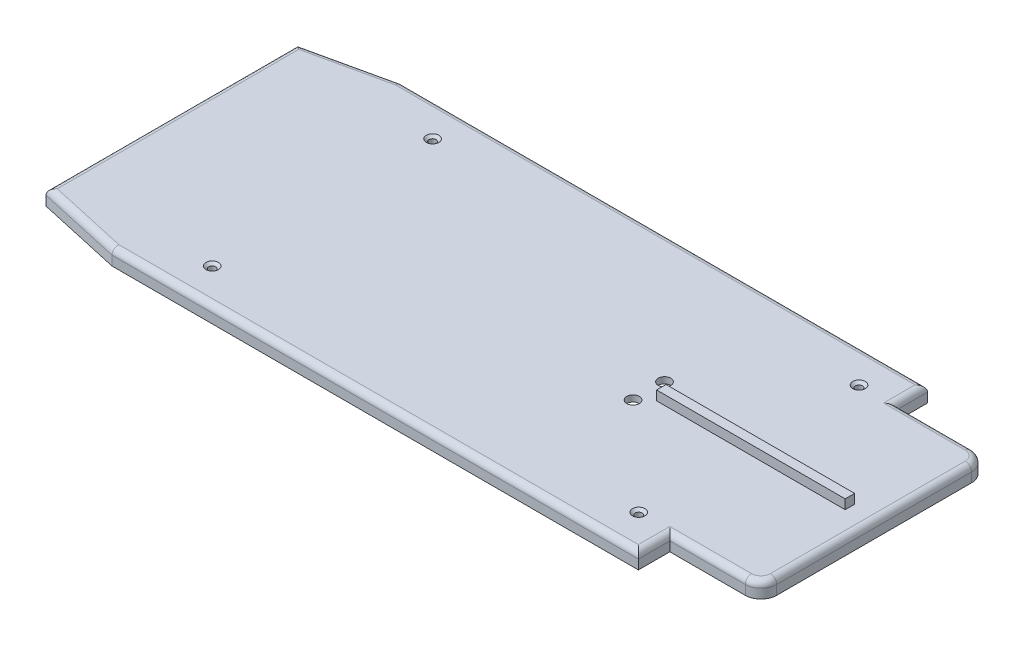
ISO-10303-21;
HEADER;
FILE_DESCRIPTION(('STEP AP214'),'2;1');
FILE_NAME('part.step','',(''),(''),'','','');
FILE_SCHEMA(('AUTOMOTIVE_DESIGN { 1 0 10303 214 1 1 1 1 }'));
ENDSEC;
DATA;
#1=APPLICATION_CONTEXT('core data for automotive mechanical design processes');
#2=APPLICATION_PROTOCOL_DEFINITION('international standard','automotive_design',2000,#1);
#3=PRODUCT_CONTEXT('',#1,'mechanical');
#4=PRODUCT('Part','Part','',(#3));
#5=PRODUCT_RELATED_PRODUCT_CATEGORY('part','',(#4));
#6=PRODUCT_DEFINITION_FORMATION('','',#4);
#7=PRODUCT_DEFINITION_CONTEXT('part definition',#1,'design');
#8=PRODUCT_DEFINITION('design','',#6,#7);
#9=PRODUCT_DEFINITION_SHAPE('','',#8);
#10=(LENGTH_UNIT() NAMED_UNIT(*) SI_UNIT(.MILLI.,.METRE.));
#11=(NAMED_UNIT(*) PLANE_ANGLE_UNIT() SI_UNIT($,.RADIAN.));
#12=(NAMED_UNIT(*) SI_UNIT($,.STERADIAN.) SOLID_ANGLE_UNIT());
#13=UNCERTAINTY_MEASURE_WITH_UNIT(LENGTH_MEASURE(1.E-05),#10,'distance_accuracy_value','');
#14=(GEOMETRIC_REPRESENTATION_CONTEXT(3) GLOBAL_UNCERTAINTY_ASSIGNED_CONTEXT((#13)) GLOBAL_UNIT_ASSIGNED_CONTEXT((#10,
#11,#12)) REPRESENTATION_CONTEXT('',''));
#15=CARTESIAN_POINT('',(0.,0.,0.));
#16=DIRECTION('',(0.,0.,1.));
#17=DIRECTION('',(1.,0.,0.));
#18=AXIS2_PLACEMENT_3D('',#15,#16,#17);
#19=CARTESIAN_POINT('',(45.72,58.42,6.35));
#20=DIRECTION('',(0.,-1.,0.));
#21=DIRECTION('',(0.,0.,-1.));
#22=AXIS2_PLACEMENT_3D('',#19,#20,#21);
#23=CYLINDRICAL_SURFACE('',#22,2.54);
#24=CARTESIAN_POINT('',(45.72,0.,6.35));
#25=DIRECTION('',(0.,1.,0.));
#26=DIRECTION('',(0.,0.,1.));
#27=AXIS2_PLACEMENT_3D('',#24,#25,#26);
#28=CIRCLE('',#27,2.54);
#29=CARTESIAN_POINT('',(45.72,0.,3.81));
#30=VERTEX_POINT('',#29);
#31=EDGE_CURVE('E458',#30,#30,#28,.T.);
#32=CARTESIAN_POINT('',(45.72,2.54,6.35));
#33=DIRECTION('',(0.,1.,0.));
#34=DIRECTION('',(0.,0.,1.));
#35=AXIS2_PLACEMENT_3D('',#32,#33,#34);
#36=CIRCLE('',#35,2.54);
#37=CARTESIAN_POINT('',(45.72,2.54,3.81));
#38=VERTEX_POINT('',#37);
#39=EDGE_CURVE('E461',#38,#38,#36,.F.);
#40=CARTESIAN_POINT('',(45.72,0.,3.81));
#41=CARTESIAN_POINT('',(45.72,0.0264583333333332,3.81));
#42=CARTESIAN_POINT('',(45.72,0.0529166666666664,3.81));
#43=CARTESIAN_POINT('',(45.72,0.105833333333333,3.81));
#44=CARTESIAN_POINT('',(45.72,0.132291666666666,3.81));
#45=CARTESIAN_POINT('',(45.72,0.185208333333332,3.81));
#46=CARTESIAN_POINT('',(45.72,0.211666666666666,3.81));
#47=CARTESIAN_POINT('',(45.72,0.264583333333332,3.81));
#48=CARTESIAN_POINT('',(45.72,0.291041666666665,3.81));
#49=CARTESIAN_POINT('',(45.72,0.343958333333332,3.81));
#50=CARTESIAN_POINT('',(45.72,0.370416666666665,3.81));
#51=CARTESIAN_POINT('',(45.72,0.423333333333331,3.81));
#52=CARTESIAN_POINT('',(45.72,0.449791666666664,3.81));
#53=CARTESIAN_POINT('',(45.72,0.502708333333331,3.81));
#54=CARTESIAN_POINT('',(45.72,0.529166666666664,3.81));
#55=CARTESIAN_POINT('',(45.72,0.58208333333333,3.81));
#56=CARTESIAN_POINT('',(45.72,0.608541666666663,3.81));
#57=CARTESIAN_POINT('',(45.72,0.661458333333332,3.81));
#58=CARTESIAN_POINT('',(45.72,0.687916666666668,3.81));
#59=CARTESIAN_POINT('',(45.72,0.740833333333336,3.81));
#60=CARTESIAN_POINT('',(45.72,0.76729166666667,3.81));
#61=CARTESIAN_POINT('',(45.72,0.820208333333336,3.81));
#62=CARTESIAN_POINT('',(45.72,0.846666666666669,3.81));
#63=CARTESIAN_POINT('',(45.72,0.899583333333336,3.81));
#64=CARTESIAN_POINT('',(45.72,0.926041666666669,3.81));
#65=CARTESIAN_POINT('',(45.72,0.978958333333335,3.81));
#66=CARTESIAN_POINT('',(45.72,1.00541666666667,3.81));
#67=CARTESIAN_POINT('',(45.72,1.05833333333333,3.81));
#68=CARTESIAN_POINT('',(45.72,1.08479166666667,3.81));
#69=CARTESIAN_POINT('',(45.72,1.13770833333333,3.81));
#70=CARTESIAN_POINT('',(45.72,1.16416666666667,3.81));
#71=CARTESIAN_POINT('',(45.72,1.21708333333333,3.81));
#72=CARTESIAN_POINT('',(45.72,1.24354166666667,3.81));
#73=CARTESIAN_POINT('',(45.72,1.29645833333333,3.81));
#74=CARTESIAN_POINT('',(45.72,1.32291666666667,3.81));
#75=CARTESIAN_POINT('',(45.72,1.37583333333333,3.81));
#76=CARTESIAN_POINT('',(45.72,1.40229166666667,3.81));
#77=CARTESIAN_POINT('',(45.72,1.45520833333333,3.81));
#78=CARTESIAN_POINT('',(45.72,1.48166666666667,3.81));
#79=CARTESIAN_POINT('',(45.72,1.53458333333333,3.81));
#80=CARTESIAN_POINT('',(45.72,1.56104166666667,3.81));
#81=CARTESIAN_POINT('',(45.72,1.61395833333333,3.81));
#82=CARTESIAN_POINT('',(45.72,1.64041666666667,3.81));
#83=CARTESIAN_POINT('',(45.72,1.69333333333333,3.81));
#84=CARTESIAN_POINT('',(45.72,1.71979166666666,3.81));
#85=CARTESIAN_POINT('',(45.72,1.77270833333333,3.81));
#86=CARTESIAN_POINT('',(45.72,1.79916666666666,3.81));
#87=CARTESIAN_POINT('',(45.72,1.85208333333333,3.81));
#88=CARTESIAN_POINT('',(45.72,1.87854166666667,3.81));
#89=CARTESIAN_POINT('',(45.72,1.93145833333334,3.81));
#90=CARTESIAN_POINT('',(45.72,1.95791666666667,3.81));
#91=CARTESIAN_POINT('',(45.72,2.01083333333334,3.81));
#92=CARTESIAN_POINT('',(45.72,2.03729166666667,3.81));
#93=CARTESIAN_POINT('',(45.72,2.09020833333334,3.81));
#94=CARTESIAN_POINT('',(45.72,2.11666666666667,3.81));
#95=CARTESIAN_POINT('',(45.72,2.16958333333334,3.81));
#96=CARTESIAN_POINT('',(45.72,2.19604166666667,3.81));
#97=CARTESIAN_POINT('',(45.72,2.24895833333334,3.81));
#98=CARTESIAN_POINT('',(45.72,2.27541666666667,3.81));
#99=CARTESIAN_POINT('',(45.72,2.32833333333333,3.81));
#100=CARTESIAN_POINT('',(45.72,2.35479166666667,3.81));
#101=CARTESIAN_POINT('',(45.72,2.40770833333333,3.81));
#102=CARTESIAN_POINT('',(45.72,2.43416666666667,3.81));
#103=CARTESIAN_POINT('',(45.72,2.48708333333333,3.81));
#104=CARTESIAN_POINT('',(45.72,2.51354166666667,3.81));
#105=CARTESIAN_POINT('',(45.72,2.54,3.81));
#106=B_SPLINE_CURVE_WITH_KNOTS('',3,(#40,#41,#42,#43,#44,#45,#46,#47,#48,#49,#50,#51,#52,#53,
#54,#55,#56,#57,#58,#59,#60,#61,#62,#63,#64,#65,#66,#67,#68,#69,#70,#71,#72,#73,#74,#75,#76,#77,
#78,#79,#80,#81,#82,#83,#84,#85,#86,#87,#88,#89,#90,#91,#92,#93,#94,#95,#96,#97,#98,#99,#100,
#101,#102,#103,#104,#105),.UNSPECIFIED.,.F.,.F.,(4,2,2,2,2,2,2,2,2,2,2,2,2,2,2,2,2,2,2,2,2,2,2,
2,2,2,2,2,2,2,2,2,4),(0.,0.0793749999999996,0.158749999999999,0.238124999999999,
0.317499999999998,0.396874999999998,0.476249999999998,0.555624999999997,0.634999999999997,
0.714375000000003,0.793750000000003,0.873125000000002,0.952500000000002,1.031875,1.11125,
1.190625,1.27,1.349375,1.42875,1.508125,1.5875,1.666875,1.74625,1.825625,1.905,1.984375,2.06375,
2.143125,2.2225,2.301875,2.38125,2.460625,2.54),.UNSPECIFIED.);
#107=EDGE_CURVE('BSEAM44',#30,#38,#106,.T.);
#108=ORIENTED_EDGE('',*,*,#31,.F.);
#109=ORIENTED_EDGE('',*,*,#39,.F.);
#110=ORIENTED_EDGE('',*,*,#107,.T.);
#111=ORIENTED_EDGE('',*,*,#107,.F.);
#112=EDGE_LOOP('',(#108,#110,#109,#111));
#113=FACE_BOUND('',#112,.T.);
#114=ADVANCED_FACE('F44',(#113),#23,.F.);
#115=CARTESIAN_POINT('',(45.72,58.42,-6.35));
#116=DIRECTION('',(0.,-1.,0.));
#117=DIRECTION('',(0.,0.,-1.));
#118=AXIS2_PLACEMENT_3D('',#115,#116,#117);
#119=CYLINDRICAL_SURFACE('',#118,2.54);
#120=CARTESIAN_POINT('',(45.72,0.,-6.35));
#121=DIRECTION('',(0.,1.,0.));
#122=DIRECTION('',(0.,0.,1.));
#123=AXIS2_PLACEMENT_3D('',#120,#121,#122);
#124=CIRCLE('',#123,2.54);
#125=CARTESIAN_POINT('',(45.72,0.,-8.89));
#126=VERTEX_POINT('',#125);
#127=EDGE_CURVE('E451',#126,#126,#124,.T.);
#128=CARTESIAN_POINT('',(45.72,2.54,-6.35));
#129=DIRECTION('',(0.,1.,0.));
#130=DIRECTION('',(0.,0.,1.));
#131=AXIS2_PLACEMENT_3D('',#128,#129,#130);
#132=CIRCLE('',#131,2.54);
#133=CARTESIAN_POINT('',(45.72,2.54,-8.89));
#134=VERTEX_POINT('',#133);
#135=EDGE_CURVE('E454',#134,#134,#132,.F.);
#136=CARTESIAN_POINT('',(45.72,0.,-8.89));
#137=CARTESIAN_POINT('',(45.72,0.0264583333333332,-8.89));
#138=CARTESIAN_POINT('',(45.72,0.0529166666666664,-8.89));
#139=CARTESIAN_POINT('',(45.72,0.105833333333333,-8.89));
#140=CARTESIAN_POINT('',(45.72,0.132291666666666,-8.89));
#141=CARTESIAN_POINT('',(45.72,0.185208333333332,-8.89));
#142=CARTESIAN_POINT('',(45.72,0.211666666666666,-8.89));
#143=CARTESIAN_POINT('',(45.72,0.264583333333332,-8.89));
#144=CARTESIAN_POINT('',(45.72,0.291041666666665,-8.89));
#145=CARTESIAN_POINT('',(45.72,0.343958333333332,-8.89));
#146=CARTESIAN_POINT('',(45.72,0.370416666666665,-8.89));
#147=CARTESIAN_POINT('',(45.72,0.423333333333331,-8.89));
#148=CARTESIAN_POINT('',(45.72,0.449791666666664,-8.89));
#149=CARTESIAN_POINT('',(45.72,0.502708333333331,-8.89));
#150=CARTESIAN_POINT('',(45.72,0.529166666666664,-8.89));
#151=CARTESIAN_POINT('',(45.72,0.58208333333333,-8.89));
#152=CARTESIAN_POINT('',(45.72,0.608541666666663,-8.89));
#153=CARTESIAN_POINT('',(45.72,0.661458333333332,-8.89));
#154=CARTESIAN_POINT('',(45.72,0.687916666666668,-8.89));
#155=CARTESIAN_POINT('',(45.72,0.740833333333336,-8.89));
#156=CARTESIAN_POINT('',(45.72,0.76729166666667,-8.89));
#157=CARTESIAN_POINT('',(45.72,0.820208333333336,-8.89));
#158=CARTESIAN_POINT('',(45.72,0.846666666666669,-8.89));
#159=CARTESIAN_POINT('',(45.72,0.899583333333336,-8.89));
#160=CARTESIAN_POINT('',(45.72,0.926041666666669,-8.89));
#161=CARTESIAN_POINT('',(45.72,0.978958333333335,-8.89));
#162=CARTESIAN_POINT('',(45.72,1.00541666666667,-8.89));
#163=CARTESIAN_POINT('',(45.72,1.05833333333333,-8.89));
#164=CARTESIAN_POINT('',(45.72,1.08479166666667,-8.89));
#165=CARTESIAN_POINT('',(45.72,1.13770833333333,-8.89));
#166=CARTESIAN_POINT('',(45.72,1.16416666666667,-8.89));
#167=CARTESIAN_POINT('',(45.72,1.21708333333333,-8.89));
#168=CARTESIAN_POINT('',(45.72,1.24354166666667,-8.89));
#169=CARTESIAN_POINT('',(45.72,1.29645833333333,-8.89));
#170=CARTESIAN_POINT('',(45.72,1.32291666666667,-8.89));
#171=CARTESIAN_POINT('',(45.72,1.37583333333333,-8.89));
#172=CARTESIAN_POINT('',(45.72,1.40229166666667,-8.89));
#173=CARTESIAN_POINT('',(45.72,1.45520833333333,-8.89));
#174=CARTESIAN_POINT('',(45.72,1.48166666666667,-8.89));
#175=CARTESIAN_POINT('',(45.72,1.53458333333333,-8.89));
#176=CARTESIAN_POINT('',(45.72,1.56104166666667,-8.89));
#177=CARTESIAN_POINT('',(45.72,1.61395833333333,-8.89));
#178=CARTESIAN_POINT('',(45.72,1.64041666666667,-8.89));
#179=CARTESIAN_POINT('',(45.72,1.69333333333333,-8.89));
#180=CARTESIAN_POINT('',(45.72,1.71979166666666,-8.89));
#181=CARTESIAN_POINT('',(45.72,1.77270833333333,-8.89));
#182=CARTESIAN_POINT('',(45.72,1.79916666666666,-8.89));
#183=CARTESIAN_POINT('',(45.72,1.85208333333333,-8.89));
#184=CARTESIAN_POINT('',(45.72,1.87854166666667,-8.89));
#185=CARTESIAN_POINT('',(45.72,1.93145833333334,-8.89));
#186=CARTESIAN_POINT('',(45.72,1.95791666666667,-8.89));
#187=CARTESIAN_POINT('',(45.72,2.01083333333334,-8.89));
#188=CARTESIAN_POINT('',(45.72,2.03729166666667,-8.89));
#189=CARTESIAN_POINT('',(45.72,2.09020833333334,-8.89));
#190=CARTESIAN_POINT('',(45.72,2.11666666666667,-8.89));
#191=CARTESIAN_POINT('',(45.72,2.16958333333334,-8.89));
#192=CARTESIAN_POINT('',(45.72,2.19604166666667,-8.89));
#193=CARTESIAN_POINT('',(45.72,2.24895833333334,-8.89));
#194=CARTESIAN_POINT('',(45.72,2.27541666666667,-8.89));
#195=CARTESIAN_POINT('',(45.72,2.32833333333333,-8.89));
#196=CARTESIAN_POINT('',(45.72,2.35479166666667,-8.89));
#197=CARTESIAN_POINT('',(45.72,2.40770833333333,-8.89));
#198=CARTESIAN_POINT('',(45.72,2.43416666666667,-8.89));
#199=CARTESIAN_POINT('',(45.72,2.48708333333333,-8.89));
#200=CARTESIAN_POINT('',(45.72,2.51354166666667,-8.89));
#201=CARTESIAN_POINT('',(45.72,2.54,-8.89));
#202=B_SPLINE_CURVE_WITH_KNOTS('',3,(#136,#137,#138,#139,#140,#141,#142,#143,#144,#145,#146,
#147,#148,#149,#150,#151,#152,#153,#154,#155,#156,#157,#158,#159,#160,#161,#162,#163,#164,#165,
#166,#167,#168,#169,#170,#171,#172,#173,#174,#175,#176,#177,#178,#179,#180,#181,#182,#183,#184,
#185,#186,#187,#188,#189,#190,#191,#192,#193,#194,#195,#196,#197,#198,#199,#200,#201),
.UNSPECIFIED.,.F.,.F.,(4,2,2,2,2,2,2,2,2,2,2,2,2,2,2,2,2,2,2,2,2,2,2,2,2,2,2,2,2,2,2,2,4),(0.,
0.0793749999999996,0.158749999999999,0.238124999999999,0.317499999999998,0.396874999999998,
0.476249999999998,0.555624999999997,0.634999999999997,0.714375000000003,0.793750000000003,
0.873125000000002,0.952500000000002,1.031875,1.11125,1.190625,1.27,1.349375,1.42875,1.508125,
1.5875,1.666875,1.74625,1.825625,1.905,1.984375,2.06375,2.143125,2.2225,2.301875,2.38125,
2.460625,2.54),.UNSPECIFIED.);
#203=EDGE_CURVE('BSEAM701',#126,#134,#202,.T.);
#204=ORIENTED_EDGE('',*,*,#127,.F.);
#205=ORIENTED_EDGE('',*,*,#135,.F.);
#206=ORIENTED_EDGE('',*,*,#203,.T.);
#207=ORIENTED_EDGE('',*,*,#203,.F.);
#208=EDGE_LOOP('',(#204,#206,#205,#207));
#209=FACE_BOUND('',#208,.T.);
#210=ADVANCED_FACE('F701',(#209),#119,.F.);
#211=CARTESIAN_POINT('',(0.,2.54,0.));
#212=DIRECTION('',(0.,1.,0.));
#213=DIRECTION('',(0.,0.,1.));
#214=AXIS2_PLACEMENT_3D('',#211,#212,#213);
#215=PLANE('',#214);
#216=DIRECTION('',(0.,0.,-1.));
#217=VECTOR('',#216,1.);
#218=CARTESIAN_POINT('',(50.8,2.54,-1.905));
#219=LINE('',#218,#217);
#220=CARTESIAN_POINT('',(50.8,2.54,1.905));
#221=VERTEX_POINT('',#220);
#222=CARTESIAN_POINT('',(50.8,2.54,-1.905));
#223=VERTEX_POINT('',#222);
#224=EDGE_CURVE('E423',#221,#223,#219,.T.);
#225=ORIENTED_EDGE('',*,*,#224,.T.);
#226=DIRECTION('',(1.,0.,0.));
#227=VECTOR('',#226,1.);
#228=CARTESIAN_POINT('',(50.8,2.54,-1.905));
#229=LINE('',#228,#227);
#230=CARTESIAN_POINT('',(127.,2.54,-1.905));
#231=VERTEX_POINT('',#230);
#232=EDGE_CURVE('E433',#223,#231,#229,.T.);
#233=ORIENTED_EDGE('',*,*,#232,.T.);
#234=DIRECTION('',(0.,0.,-1.));
#235=VECTOR('',#234,1.);
#236=CARTESIAN_POINT('',(127.,2.54,-1.905));
#237=LINE('',#236,#235);
#238=CARTESIAN_POINT('',(127.,2.54,1.905));
#239=VERTEX_POINT('',#238);
#240=EDGE_CURVE('E422',#239,#231,#237,.T.);
#241=ORIENTED_EDGE('',*,*,#240,.F.);
#242=DIRECTION('',(1.,0.,0.));
#243=VECTOR('',#242,1.);
#244=CARTESIAN_POINT('',(50.8,2.54,1.905));
#245=LINE('',#244,#243);
#246=EDGE_CURVE('E441',#221,#239,#245,.T.);
#247=ORIENTED_EDGE('',*,*,#246,.F.);
#248=EDGE_LOOP('',(#225,#233,#241,#247));
#249=FACE_BOUND('',#248,.T.);
#250=ORIENTED_EDGE('',*,*,#135,.T.);
#251=EDGE_LOOP('',(#250));
#252=FACE_BOUND('',#251,.T.);
#253=ORIENTED_EDGE('',*,*,#39,.T.);
#254=EDGE_LOOP('',(#253));
#255=FACE_BOUND('',#254,.T.);
#256=DIRECTION('',(1.,0.,0.));
#257=VECTOR('',#256,1.);
#258=CARTESIAN_POINT('',(0.,2.54,-55.88));
#259=LINE('',#258,#257);
#260=CARTESIAN_POINT('',(97.409,2.54,-55.88));
#261=VERTEX_POINT('',#260);
#262=CARTESIAN_POINT('',(-112.497178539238,2.54,-55.88));
#263=VERTEX_POINT('',#262);
#264=EDGE_CURVE('E601',#261,#263,#259,.F.);
#265=ORIENTED_EDGE('',*,*,#264,.T.);
#266=DIRECTION('',(-0.976187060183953,0.,0.216930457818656));
#267=VECTOR('',#266,1.);
#268=CARTESIAN_POINT('',(-17.1273966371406,2.54,-77.0732848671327));
#269=LINE('',#268,#267);
#270=CARTESIAN_POINT('',(-144.526,2.54,-48.7624841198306));
#271=VERTEX_POINT('',#270);
#272=EDGE_CURVE('E547',#263,#271,#269,.T.);
#273=ORIENTED_EDGE('',*,*,#272,.T.);
#274=DIRECTION('',(0.,0.,1.));
#275=VECTOR('',#274,1.);
#276=CARTESIAN_POINT('',(-144.526,2.54,0.));
#277=LINE('',#276,#275);
#278=CARTESIAN_POINT('',(-144.526,2.54,48.7624841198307));
#279=VERTEX_POINT('',#278);
#280=EDGE_CURVE('E603',#271,#279,#277,.T.);
#281=ORIENTED_EDGE('',*,*,#280,.T.);
#282=DIRECTION('',(0.976187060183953,0.,0.216930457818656));
#283=VECTOR('',#282,1.);
#284=CARTESIAN_POINT('',(-17.1273966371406,2.54,77.0732848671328));
#285=LINE('',#284,#283);
#286=CARTESIAN_POINT('',(-112.497178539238,2.54,55.88));
#287=VERTEX_POINT('',#286);
#288=EDGE_CURVE('E605',#279,#287,#285,.T.);
#289=ORIENTED_EDGE('',*,*,#288,.T.);
#290=DIRECTION('',(-1.,0.,0.));
#291=VECTOR('',#290,1.);
#292=CARTESIAN_POINT('',(99.949,2.54,55.88));
#293=LINE('',#292,#291);
#294=CARTESIAN_POINT('',(97.409,2.54,55.88));
#295=VERTEX_POINT('',#294);
#296=EDGE_CURVE('E607',#287,#295,#293,.F.);
#297=ORIENTED_EDGE('',*,*,#296,.T.);
#298=DIRECTION('',(0.,0.,1.));
#299=VECTOR('',#298,1.);
#300=CARTESIAN_POINT('',(97.409,2.54,0.));
#301=LINE('',#300,#299);
#302=CARTESIAN_POINT('',(97.409,2.54,43.18));
#303=VERTEX_POINT('',#302);
#304=EDGE_CURVE('E614',#295,#303,#301,.F.);
#305=ORIENTED_EDGE('',*,*,#304,.T.);
#306=DIRECTION('',(-1.,0.,0.));
#307=VECTOR('',#306,1.);
#308=CARTESIAN_POINT('',(130.429,2.54,43.18));
#309=LINE('',#308,#307);
#310=CARTESIAN_POINT('',(130.429,2.54,43.18));
#311=VERTEX_POINT('',#310);
#312=EDGE_CURVE('E12',#303,#311,#309,.F.);
#313=ORIENTED_EDGE('',*,*,#312,.T.);
#314=CARTESIAN_POINT('',(130.429,2.54,39.37));
#315=DIRECTION('',(0.,1.,0.));
#316=DIRECTION('',(0.,0.,1.));
#317=AXIS2_PLACEMENT_3D('',#314,#315,#316);
#318=CIRCLE('',#317,3.81);
#319=CARTESIAN_POINT('',(134.239,2.54,39.37));
#320=VERTEX_POINT('',#319);
#321=EDGE_CURVE('E53',#311,#320,#318,.T.);
#322=ORIENTED_EDGE('',*,*,#321,.T.);
#323=DIRECTION('',(0.,0.,1.));
#324=VECTOR('',#323,1.);
#325=CARTESIAN_POINT('',(134.239,2.54,0.));
#326=LINE('',#325,#324);
#327=CARTESIAN_POINT('',(134.239,2.54,-39.37));
#328=VERTEX_POINT('',#327);
#329=EDGE_CURVE('E617',#320,#328,#326,.F.);
#330=ORIENTED_EDGE('',*,*,#329,.T.);
#331=CARTESIAN_POINT('',(130.429,2.54,-39.37));
#332=DIRECTION('',(0.,1.,0.));
#333=DIRECTION('',(0.,0.,1.));
#334=AXIS2_PLACEMENT_3D('',#331,#332,#333);
#335=CIRCLE('',#334,3.81);
#336=CARTESIAN_POINT('',(130.429,2.54,-43.18));
#337=VERTEX_POINT('',#336);
#338=EDGE_CURVE('E612',#328,#337,#335,.T.);
#339=ORIENTED_EDGE('',*,*,#338,.T.);
#340=DIRECTION('',(-1.,0.,0.));
#341=VECTOR('',#340,1.);
#342=CARTESIAN_POINT('',(99.949,2.54,-43.18));
#343=LINE('',#342,#341);
#344=CARTESIAN_POINT('',(97.409,2.54,-43.18));
#345=VERTEX_POINT('',#344);
#346=EDGE_CURVE('E610',#337,#345,#343,.T.);
#347=ORIENTED_EDGE('',*,*,#346,.T.);
#348=DIRECTION('',(0.,0.,1.));
#349=VECTOR('',#348,1.);
#350=CARTESIAN_POINT('',(97.409,2.54,0.));
#351=LINE('',#350,#349);
#352=EDGE_CURVE('E583',#345,#261,#351,.F.);
#353=ORIENTED_EDGE('',*,*,#352,.T.);
#354=EDGE_LOOP('',(#265,#273,#281,#289,#297,#305,#313,#322,#330,#339,#347,#353));
#355=FACE_BOUND('',#354,.T.);
#356=CARTESIAN_POINT('',(86.1695,2.54,44.5135));
#357=DIRECTION('',(0.,1.,0.));
#358=DIRECTION('',(0.,0.,1.));
#359=AXIS2_PLACEMENT_3D('',#356,#357,#358);
#360=CIRCLE('',#359,2.5273);
#361=CARTESIAN_POINT('',(86.1695,2.54,47.0408));
#362=VERTEX_POINT('',#361);
#363=EDGE_CURVE('E470',#362,#362,#360,.T.);
#364=ORIENTED_EDGE('',*,*,#363,.F.);
#365=EDGE_LOOP('',(#364));
#366=FACE_BOUND('',#365,.T.);
#367=CARTESIAN_POINT('',(86.1695,2.54,-44.5135));
#368=DIRECTION('',(0.,1.,0.));
#369=DIRECTION('',(0.,0.,1.));
#370=AXIS2_PLACEMENT_3D('',#367,#368,#369);
#371=CIRCLE('',#370,2.5273);
#372=CARTESIAN_POINT('',(86.1695,2.54,-41.9862));
#373=VERTEX_POINT('',#372);
#374=EDGE_CURVE('E464',#373,#373,#371,.T.);
#375=ORIENTED_EDGE('',*,*,#374,.F.);
#376=EDGE_LOOP('',(#375));
#377=FACE_BOUND('',#376,.T.);
#378=CARTESIAN_POINT('',(-86.1695,2.54,-44.5135));
#379=DIRECTION('',(0.,1.,0.));
#380=DIRECTION('',(0.,0.,1.));
#381=AXIS2_PLACEMENT_3D('',#378,#379,#380);
#382=CIRCLE('',#381,2.5273);
#383=CARTESIAN_POINT('',(-86.1695,2.54,-41.9862));
#384=VERTEX_POINT('',#383);
#385=EDGE_CURVE('E476',#384,#384,#382,.T.);
#386=ORIENTED_EDGE('',*,*,#385,.F.);
#387=EDGE_LOOP('',(#386));
#388=FACE_BOUND('',#387,.T.);
#389=CARTESIAN_POINT('',(-86.1695,2.54,44.5135));
#390=DIRECTION('',(0.,1.,0.));
#391=DIRECTION('',(0.,0.,1.));
#392=AXIS2_PLACEMENT_3D('',#389,#390,#391);
#393=CIRCLE('',#392,2.5273);
#394=CARTESIAN_POINT('',(-86.1695,2.54,47.0408));
#395=VERTEX_POINT('',#394);
#396=EDGE_CURVE('E482',#395,#395,#393,.T.);
#397=ORIENTED_EDGE('',*,*,#396,.F.);
#398=EDGE_LOOP('',(#397));
#399=FACE_BOUND('',#398,.T.);
#400=ADVANCED_FACE('F638',(#249,#252,#255,#355,#366,#377,#388,#399),#215,.T.);
#401=CARTESIAN_POINT('',(0.,0.,0.));
#402=DIRECTION('',(0.,1.,0.));
#403=DIRECTION('',(0.,0.,1.));
#404=AXIS2_PLACEMENT_3D('',#401,#402,#403);
#405=PLANE('',#404);
#406=DIRECTION('',(0.,0.,1.));
#407=VECTOR('',#406,1.);
#408=CARTESIAN_POINT('',(134.239,0.,39.37));
#409=LINE('',#408,#407);
#410=CARTESIAN_POINT('',(134.239,0.,-39.3699999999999));
#411=VERTEX_POINT('',#410);
#412=CARTESIAN_POINT('',(134.239,0.,39.37));
#413=VERTEX_POINT('',#412);
#414=EDGE_CURVE('E277',#411,#413,#409,.T.);
#415=ORIENTED_EDGE('',*,*,#414,.T.);
#416=CARTESIAN_POINT('',(130.429,0.,39.37));
#417=DIRECTION('',(0.,-1.,0.));
#418=DIRECTION('',(0.,0.,1.));
#419=AXIS2_PLACEMENT_3D('',#416,#417,#418);
#420=CIRCLE('',#419,3.81);
#421=CARTESIAN_POINT('',(130.429,0.,43.18));
#422=VERTEX_POINT('',#421);
#423=EDGE_CURVE('E314',#413,#422,#420,.T.);
#424=ORIENTED_EDGE('',*,*,#423,.T.);
#425=DIRECTION('',(-1.,0.,0.));
#426=VECTOR('',#425,1.);
#427=CARTESIAN_POINT('',(97.409,0.,43.18));
#428=LINE('',#427,#426);
#429=CARTESIAN_POINT('',(97.409,0.,43.18));
#430=VERTEX_POINT('',#429);
#431=EDGE_CURVE('E283',#422,#430,#428,.T.);
#432=ORIENTED_EDGE('',*,*,#431,.T.);
#433=DIRECTION('',(0.,0.,1.));
#434=VECTOR('',#433,1.);
#435=CARTESIAN_POINT('',(97.409,0.,55.88));
#436=LINE('',#435,#434);
#437=CARTESIAN_POINT('',(97.409,0.,55.88));
#438=VERTEX_POINT('',#437);
#439=EDGE_CURVE('E318',#430,#438,#436,.T.);
#440=ORIENTED_EDGE('',*,*,#439,.T.);
#441=DIRECTION('',(-1.,0.,0.));
#442=VECTOR('',#441,1.);
#443=CARTESIAN_POINT('',(-112.497178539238,0.,55.88));
#444=LINE('',#443,#442);
#445=CARTESIAN_POINT('',(-112.497178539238,0.,55.88));
#446=VERTEX_POINT('',#445);
#447=EDGE_CURVE('E321',#438,#446,#444,.T.);
#448=ORIENTED_EDGE('',*,*,#447,.T.);
#449=DIRECTION('',(-0.976187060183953,0.,-0.216930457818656));
#450=VECTOR('',#449,1.);
#451=CARTESIAN_POINT('',(-144.526,0.,48.7624841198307));
#452=LINE('',#451,#450);
#453=CARTESIAN_POINT('',(-144.526,0.,48.7624841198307));
#454=VERTEX_POINT('',#453);
#455=EDGE_CURVE('E324',#446,#454,#452,.T.);
#456=ORIENTED_EDGE('',*,*,#455,.T.);
#457=DIRECTION('',(0.,0.,-1.));
#458=VECTOR('',#457,1.);
#459=CARTESIAN_POINT('',(-144.526,0.,-48.7624841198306));
#460=LINE('',#459,#458);
#461=CARTESIAN_POINT('',(-144.526,0.,-48.7624841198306));
#462=VERTEX_POINT('',#461);
#463=EDGE_CURVE('E327',#454,#462,#460,.T.);
#464=ORIENTED_EDGE('',*,*,#463,.T.);
#465=DIRECTION('',(0.976187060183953,0.,-0.216930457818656));
#466=VECTOR('',#465,1.);
#467=CARTESIAN_POINT('',(-112.497178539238,0.,-55.88));
#468=LINE('',#467,#466);
#469=CARTESIAN_POINT('',(-112.497178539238,0.,-55.88));
#470=VERTEX_POINT('',#469);
#471=EDGE_CURVE('E330',#462,#470,#468,.T.);
#472=ORIENTED_EDGE('',*,*,#471,.T.);
#473=DIRECTION('',(1.,0.,0.));
#474=VECTOR('',#473,1.);
#475=CARTESIAN_POINT('',(97.409,0.,-55.88));
#476=LINE('',#475,#474);
#477=CARTESIAN_POINT('',(97.409,0.,-55.88));
#478=VERTEX_POINT('',#477);
#479=EDGE_CURVE('E333',#470,#478,#476,.T.);
#480=ORIENTED_EDGE('',*,*,#479,.T.);
#481=DIRECTION('',(0.,0.,1.));
#482=VECTOR('',#481,1.);
#483=CARTESIAN_POINT('',(97.409,0.,-43.1799999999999));
#484=LINE('',#483,#482);
#485=CARTESIAN_POINT('',(97.409,0.,-43.1799999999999));
#486=VERTEX_POINT('',#485);
#487=EDGE_CURVE('E336',#478,#486,#484,.T.);
#488=ORIENTED_EDGE('',*,*,#487,.T.);
#489=DIRECTION('',(1.,0.,0.));
#490=VECTOR('',#489,1.);
#491=CARTESIAN_POINT('',(130.429,0.,-43.1799999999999));
#492=LINE('',#491,#490);
#493=CARTESIAN_POINT('',(130.429,0.,-43.1799999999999));
#494=VERTEX_POINT('',#493);
#495=EDGE_CURVE('E339',#486,#494,#492,.T.);
#496=ORIENTED_EDGE('',*,*,#495,.T.);
#497=CARTESIAN_POINT('',(130.429,0.,-39.3699999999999));
#498=DIRECTION('',(0.,-1.,0.));
#499=DIRECTION('',(0.,0.,-1.));
#500=AXIS2_PLACEMENT_3D('',#497,#498,#499);
#501=CIRCLE('',#500,3.81);
#502=EDGE_CURVE('E342',#494,#411,#501,.T.);
#503=ORIENTED_EDGE('',*,*,#502,.T.);
#504=EDGE_LOOP('',(#415,#424,#432,#440,#448,#456,#464,#472,#480,#488,#496,#503));
#505=FACE_BOUND('',#504,.T.);
#506=ORIENTED_EDGE('',*,*,#31,.T.);
#507=EDGE_LOOP('',(#506));
#508=FACE_BOUND('',#507,.T.);
#509=CARTESIAN_POINT('',(86.1695,0.,-44.5135));
#510=DIRECTION('',(0.,1.,0.));
#511=DIRECTION('',(0.,0.,1.));
#512=AXIS2_PLACEMENT_3D('',#509,#510,#511);
#513=CIRCLE('',#512,3.81);
#514=CARTESIAN_POINT('',(86.1695,0.,-40.7035));
#515=VERTEX_POINT('',#514);
#516=EDGE_CURVE('E513',#515,#515,#513,.F.);
#517=ORIENTED_EDGE('',*,*,#516,.F.);
#518=EDGE_LOOP('',(#517));
#519=FACE_BOUND('',#518,.T.);
#520=CARTESIAN_POINT('',(-86.1695,0.,44.5135));
#521=DIRECTION('',(0.,1.,0.));
#522=DIRECTION('',(0.,0.,1.));
#523=AXIS2_PLACEMENT_3D('',#520,#521,#522);
#524=CIRCLE('',#523,3.81);
#525=CARTESIAN_POINT('',(-86.1695,0.,48.3235));
#526=VERTEX_POINT('',#525);
#527=EDGE_CURVE('E520',#526,#526,#524,.F.);
#528=ORIENTED_EDGE('',*,*,#527,.F.);
#529=EDGE_LOOP('',(#528));
#530=FACE_BOUND('',#529,.T.);
#531=CARTESIAN_POINT('',(-86.1695,0.,-44.5135));
#532=DIRECTION('',(0.,1.,0.));
#533=DIRECTION('',(0.,0.,1.));
#534=AXIS2_PLACEMENT_3D('',#531,#532,#533);
#535=CIRCLE('',#534,3.81);
#536=CARTESIAN_POINT('',(-86.1695,0.,-40.7035));
#537=VERTEX_POINT('',#536);
#538=EDGE_CURVE('E523',#537,#537,#535,.F.);
#539=ORIENTED_EDGE('',*,*,#538,.F.);
#540=EDGE_LOOP('',(#539));
#541=FACE_BOUND('',#540,.T.);
#542=CARTESIAN_POINT('',(86.1695,0.,44.5135));
#543=DIRECTION('',(0.,1.,0.));
#544=DIRECTION('',(0.,0.,1.));
#545=AXIS2_PLACEMENT_3D('',#542,#543,#544);
#546=CIRCLE('',#545,3.81);
#547=CARTESIAN_POINT('',(86.1695,0.,48.3235));
#548=VERTEX_POINT('',#547);
#549=EDGE_CURVE('E517',#548,#548,#546,.F.);
#550=ORIENTED_EDGE('',*,*,#549,.F.);
#551=EDGE_LOOP('',(#550));
#552=FACE_BOUND('',#551,.T.);
#553=ORIENTED_EDGE('',*,*,#127,.T.);
#554=EDGE_LOOP('',(#553));
#555=FACE_BOUND('',#554,.T.);
#556=ADVANCED_FACE('F760',(#505,#508,#519,#530,#541,#552,#555),#405,.F.);
#557=CARTESIAN_POINT('',(-86.1695,-3.81,-44.5135));
#558=DIRECTION('',(0.,1.,0.));
#559=DIRECTION('',(0.,0.,1.));
#560=AXIS2_PLACEMENT_3D('',#557,#558,#559);
#561=CYLINDRICAL_SURFACE('',#560,3.81);
#562=CARTESIAN_POINT('',(-86.1695,-7.62,-44.5135));
#563=DIRECTION('',(0.,-1.,0.));
#564=DIRECTION('',(0.,0.,-1.));
#565=AXIS2_PLACEMENT_3D('',#562,#563,#564);
#566=CIRCLE('',#565,3.81);
#567=CARTESIAN_POINT('',(-86.1695,-7.62,-40.7035));
#568=VERTEX_POINT('',#567);
#569=EDGE_CURVE('E1332',#568,#568,#566,.T.);
#570=CARTESIAN_POINT('',(-86.1695,0.,-40.7035));
#571=CARTESIAN_POINT('',(-86.1695,-0.079375,-40.7035));
#572=CARTESIAN_POINT('',(-86.1695,-0.15875,-40.7035));
#573=CARTESIAN_POINT('',(-86.1695,-0.3175,-40.7035));
#574=CARTESIAN_POINT('',(-86.1695,-0.396875,-40.7035));
#575=CARTESIAN_POINT('',(-86.1695,-0.555625,-40.7035));
#576=CARTESIAN_POINT('',(-86.1695,-0.635,-40.7035));
#577=CARTESIAN_POINT('',(-86.1695,-0.79375,-40.7035));
#578=CARTESIAN_POINT('',(-86.1695,-0.873125,-40.7035));
#579=CARTESIAN_POINT('',(-86.1695,-1.031875,-40.7035));
#580=CARTESIAN_POINT('',(-86.1695,-1.11125,-40.7035));
#581=CARTESIAN_POINT('',(-86.1695,-1.27,-40.7035));
#582=CARTESIAN_POINT('',(-86.1695,-1.349375,-40.7035));
#583=CARTESIAN_POINT('',(-86.1695,-1.508125,-40.7035));
#584=CARTESIAN_POINT('',(-86.1695,-1.5875,-40.7035));
#585=CARTESIAN_POINT('',(-86.1695,-1.74625,-40.7035));
#586=CARTESIAN_POINT('',(-86.1695,-1.825625,-40.7035));
#587=CARTESIAN_POINT('',(-86.1695,-1.984375,-40.7035));
#588=CARTESIAN_POINT('',(-86.1695,-2.06375,-40.7035));
#589=CARTESIAN_POINT('',(-86.1695,-2.2225,-40.7035));
#590=CARTESIAN_POINT('',(-86.1695,-2.301875,-40.7035));
#591=CARTESIAN_POINT('',(-86.1695,-2.460625,-40.7035));
#592=CARTESIAN_POINT('',(-86.1695,-2.54,-40.7035));
#593=CARTESIAN_POINT('',(-86.1695,-2.69875,-40.7035));
#594=CARTESIAN_POINT('',(-86.1695,-2.778125,-40.7035));
#595=CARTESIAN_POINT('',(-86.1695,-2.936875,-40.7035));
#596=CARTESIAN_POINT('',(-86.1695,-3.01625,-40.7035));
#597=CARTESIAN_POINT('',(-86.1695,-3.175,-40.7035));
#598=CARTESIAN_POINT('',(-86.1695,-3.254375,-40.7035));
#599=CARTESIAN_POINT('',(-86.1695,-3.413125,-40.7035));
#600=CARTESIAN_POINT('',(-86.1695,-3.4925,-40.7035));
#601=CARTESIAN_POINT('',(-86.1695,-3.65125,-40.7035));
#602=CARTESIAN_POINT('',(-86.1695,-3.730625,-40.7035));
#603=CARTESIAN_POINT('',(-86.1695,-3.889375,-40.7035));
#604=CARTESIAN_POINT('',(-86.1695,-3.96875,-40.7035));
#605=CARTESIAN_POINT('',(-86.1695,-4.1275,-40.7035));
#606=CARTESIAN_POINT('',(-86.1695,-4.206875,-40.7035));
#607=CARTESIAN_POINT('',(-86.1695,-4.365625,-40.7035));
#608=CARTESIAN_POINT('',(-86.1695,-4.445,-40.7035));
#609=CARTESIAN_POINT('',(-86.1695,-4.60375,-40.7035));
#610=CARTESIAN_POINT('',(-86.1695,-4.683125,-40.7035));
#611=CARTESIAN_POINT('',(-86.1695,-4.841875,-40.7035));
#612=CARTESIAN_POINT('',(-86.1695,-4.92125,-40.7035));
#613=CARTESIAN_POINT('',(-86.1695,-5.08,-40.7035));
#614=CARTESIAN_POINT('',(-86.1695,-5.159375,-40.7035));
#615=CARTESIAN_POINT('',(-86.1695,-5.318125,-40.7035));
#616=CARTESIAN_POINT('',(-86.1695,-5.3975,-40.7035));
#617=CARTESIAN_POINT('',(-86.1695,-5.55625,-40.7035));
#618=CARTESIAN_POINT('',(-86.1695,-5.635625,-40.7035));
#619=CARTESIAN_POINT('',(-86.1695,-5.794375,-40.7035));
#620=CARTESIAN_POINT('',(-86.1695,-5.87375,-40.7035));
#621=CARTESIAN_POINT('',(-86.1695,-6.0325,-40.7035));
#622=CARTESIAN_POINT('',(-86.1695,-6.111875,-40.7035));
#623=CARTESIAN_POINT('',(-86.1695,-6.270625,-40.7035));
#624=CARTESIAN_POINT('',(-86.1695,-6.35,-40.7035));
#625=CARTESIAN_POINT('',(-86.1695,-6.50875,-40.7035));
#626=CARTESIAN_POINT('',(-86.1695,-6.588125,-40.7035));
#627=CARTESIAN_POINT('',(-86.1695,-6.746875,-40.7035));
#628=CARTESIAN_POINT('',(-86.1695,-6.82625,-40.7035));
#629=CARTESIAN_POINT('',(-86.1695,-6.985,-40.7035));
#630=CARTESIAN_POINT('',(-86.1695,-7.064375,-40.7035));
#631=CARTESIAN_POINT('',(-86.1695,-7.223125,-40.7035));
#632=CARTESIAN_POINT('',(-86.1695,-7.3025,-40.7035));
#633=CARTESIAN_POINT('',(-86.1695,-7.46125,-40.7035));
#634=CARTESIAN_POINT('',(-86.1695,-7.540625,-40.7035));
#635=CARTESIAN_POINT('',(-86.1695,-7.62,-40.7035));
#636=B_SPLINE_CURVE_WITH_KNOTS('',3,(#570,#571,#572,#573,#574,#575,#576,#577,#578,#579,#580,
#581,#582,#583,#584,#585,#586,#587,#588,#589,#590,#591,#592,#593,#594,#595,#596,#597,#598,#599,
#600,#601,#602,#603,#604,#605,#606,#607,#608,#609,#610,#611,#612,#613,#614,#615,#616,#617,#618,
#619,#620,#621,#622,#623,#624,#625,#626,#627,#628,#629,#630,#631,#632,#633,#634,#635),
.UNSPECIFIED.,.F.,.F.,(4,2,2,2,2,2,2,2,2,2,2,2,2,2,2,2,2,2,2,2,2,2,2,2,2,2,2,2,2,2,2,2,4),(0.,
0.238125,0.47625,0.714375,0.9525,1.190625,1.42875,1.666875,1.905,2.143125,2.38125,2.619375,
2.8575,3.095625,3.33375,3.571875,3.81,4.048125,4.28625,4.524375,4.7625,5.000625,5.23875,
5.476875,5.715,5.953125,6.19125,6.429375,6.6675,6.905625,7.14375,7.381875,7.62),.UNSPECIFIED.);
#637=EDGE_CURVE('BSEAM756',#537,#568,#636,.T.);
#638=ORIENTED_EDGE('',*,*,#538,.T.);
#639=ORIENTED_EDGE('',*,*,#569,.F.);
#640=ORIENTED_EDGE('',*,*,#637,.T.);
#641=ORIENTED_EDGE('',*,*,#637,.F.);
#642=EDGE_LOOP('',(#638,#640,#639,#641));
#643=FACE_BOUND('',#642,.T.);
#644=ADVANCED_FACE('F756',(#643),#561,.T.);
#645=CARTESIAN_POINT('',(-86.1695,-3.81,44.5135));
#646=DIRECTION('',(0.,1.,0.));
#647=DIRECTION('',(0.,0.,1.));
#648=AXIS2_PLACEMENT_3D('',#645,#646,#647);
#649=CYLINDRICAL_SURFACE('',#648,3.81);
#650=CARTESIAN_POINT('',(-86.1695,-7.62,44.5135));
#651=DIRECTION('',(0.,-1.,0.));
#652=DIRECTION('',(0.,0.,-1.));
#653=AXIS2_PLACEMENT_3D('',#650,#651,#652);
#654=CIRCLE('',#653,3.81);
#655=CARTESIAN_POINT('',(-86.1695,-7.62,48.3235));
#656=VERTEX_POINT('',#655);
#657=EDGE_CURVE('E316',#656,#656,#654,.T.);
#658=CARTESIAN_POINT('',(-86.1695,0.,48.3235));
#659=CARTESIAN_POINT('',(-86.1695,-0.079375,48.3235));
#660=CARTESIAN_POINT('',(-86.1695,-0.15875,48.3235));
#661=CARTESIAN_POINT('',(-86.1695,-0.3175,48.3235));
#662=CARTESIAN_POINT('',(-86.1695,-0.396875,48.3235));
#663=CARTESIAN_POINT('',(-86.1695,-0.555625,48.3235));
#664=CARTESIAN_POINT('',(-86.1695,-0.635,48.3235));
#665=CARTESIAN_POINT('',(-86.1695,-0.79375,48.3235));
#666=CARTESIAN_POINT('',(-86.1695,-0.873125,48.3235));
#667=CARTESIAN_POINT('',(-86.1695,-1.031875,48.3235));
#668=CARTESIAN_POINT('',(-86.1695,-1.11125,48.3235));
#669=CARTESIAN_POINT('',(-86.1695,-1.27,48.3235));
#670=CARTESIAN_POINT('',(-86.1695,-1.349375,48.3235));
#671=CARTESIAN_POINT('',(-86.1695,-1.508125,48.3235));
#672=CARTESIAN_POINT('',(-86.1695,-1.5875,48.3235));
#673=CARTESIAN_POINT('',(-86.1695,-1.74625,48.3235));
#674=CARTESIAN_POINT('',(-86.1695,-1.825625,48.3235));
#675=CARTESIAN_POINT('',(-86.1695,-1.984375,48.3235));
#676=CARTESIAN_POINT('',(-86.1695,-2.06375,48.3235));
#677=CARTESIAN_POINT('',(-86.1695,-2.2225,48.3235));
#678=CARTESIAN_POINT('',(-86.1695,-2.301875,48.3235));
#679=CARTESIAN_POINT('',(-86.1695,-2.460625,48.3235));
#680=CARTESIAN_POINT('',(-86.1695,-2.54,48.3235));
#681=CARTESIAN_POINT('',(-86.1695,-2.69875,48.3235));
#682=CARTESIAN_POINT('',(-86.1695,-2.778125,48.3235));
#683=CARTESIAN_POINT('',(-86.1695,-2.936875,48.3235));
#684=CARTESIAN_POINT('',(-86.1695,-3.01625,48.3235));
#685=CARTESIAN_POINT('',(-86.1695,-3.175,48.3235));
#686=CARTESIAN_POINT('',(-86.1695,-3.254375,48.3235));
#687=CARTESIAN_POINT('',(-86.1695,-3.413125,48.3235));
#688=CARTESIAN_POINT('',(-86.1695,-3.4925,48.3235));
#689=CARTESIAN_POINT('',(-86.1695,-3.65125,48.3235));
#690=CARTESIAN_POINT('',(-86.1695,-3.730625,48.3235));
#691=CARTESIAN_POINT('',(-86.1695,-3.889375,48.3235));
#692=CARTESIAN_POINT('',(-86.1695,-3.96875,48.3235));
#693=CARTESIAN_POINT('',(-86.1695,-4.1275,48.3235));
#694=CARTESIAN_POINT('',(-86.1695,-4.206875,48.3235));
#695=CARTESIAN_POINT('',(-86.1695,-4.365625,48.3235));
#696=CARTESIAN_POINT('',(-86.1695,-4.445,48.3235));
#697=CARTESIAN_POINT('',(-86.1695,-4.60375,48.3235));
#698=CARTESIAN_POINT('',(-86.1695,-4.683125,48.3235));
#699=CARTESIAN_POINT('',(-86.1695,-4.841875,48.3235));
#700=CARTESIAN_POINT('',(-86.1695,-4.92125,48.3235));
#701=CARTESIAN_POINT('',(-86.1695,-5.08,48.3235));
#702=CARTESIAN_POINT('',(-86.1695,-5.159375,48.3235));
#703=CARTESIAN_POINT('',(-86.1695,-5.318125,48.3235));
#704=CARTESIAN_POINT('',(-86.1695,-5.3975,48.3235));
#705=CARTESIAN_POINT('',(-86.1695,-5.55625,48.3235));
#706=CARTESIAN_POINT('',(-86.1695,-5.635625,48.3235));
#707=CARTESIAN_POINT('',(-86.1695,-5.794375,48.3235));
#708=CARTESIAN_POINT('',(-86.1695,-5.87375,48.3235));
#709=CARTESIAN_POINT('',(-86.1695,-6.0325,48.3235));
#710=CARTESIAN_POINT('',(-86.1695,-6.111875,48.3235));
#711=CARTESIAN_POINT('',(-86.1695,-6.270625,48.3235));
#712=CARTESIAN_POINT('',(-86.1695,-6.35,48.3235));
#713=CARTESIAN_POINT('',(-86.1695,-6.50875,48.3235));
#714=CARTESIAN_POINT('',(-86.1695,-6.588125,48.3235));
#715=CARTESIAN_POINT('',(-86.1695,-6.746875,48.3235));
#716=CARTESIAN_POINT('',(-86.1695,-6.82625,48.3235));
#717=CARTESIAN_POINT('',(-86.1695,-6.985,48.3235));
#718=CARTESIAN_POINT('',(-86.1695,-7.064375,48.3235));
#719=CARTESIAN_POINT('',(-86.1695,-7.223125,48.3235));
#720=CARTESIAN_POINT('',(-86.1695,-7.3025,48.3235));
#721=CARTESIAN_POINT('',(-86.1695,-7.46125,48.3235));
#722=CARTESIAN_POINT('',(-86.1695,-7.540625,48.3235));
#723=CARTESIAN_POINT('',(-86.1695,-7.62,48.3235));
#724=B_SPLINE_CURVE_WITH_KNOTS('',3,(#658,#659,#660,#661,#662,#663,#664,#665,#666,#667,#668,
#669,#670,#671,#672,#673,#674,#675,#676,#677,#678,#679,#680,#681,#682,#683,#684,#685,#686,#687,
#688,#689,#690,#691,#692,#693,#694,#695,#696,#697,#698,#699,#700,#701,#702,#703,#704,#705,#706,
#707,#708,#709,#710,#711,#712,#713,#714,#715,#716,#717,#718,#719,#720,#721,#722,#723),
.UNSPECIFIED.,.F.,.F.,(4,2,2,2,2,2,2,2,2,2,2,2,2,2,2,2,2,2,2,2,2,2,2,2,2,2,2,2,2,2,2,2,4),(0.,
0.238125,0.47625,0.714375,0.9525,1.190625,1.42875,1.666875,1.905,2.143125,2.38125,2.619375,
2.8575,3.095625,3.33375,3.571875,3.81,4.048125,4.28625,4.524375,4.7625,5.000625,5.23875,
5.476875,5.715,5.953125,6.19125,6.429375,6.6675,6.905625,7.14375,7.381875,7.62),.UNSPECIFIED.);
#725=EDGE_CURVE('BSEAM752',#526,#656,#724,.T.);
#726=ORIENTED_EDGE('',*,*,#527,.T.);
#727=ORIENTED_EDGE('',*,*,#657,.F.);
#728=ORIENTED_EDGE('',*,*,#725,.T.);
#729=ORIENTED_EDGE('',*,*,#725,.F.);
#730=EDGE_LOOP('',(#726,#728,#727,#729));
#731=FACE_BOUND('',#730,.T.);
#732=ADVANCED_FACE('F752',(#731),#649,.T.);
#733=CARTESIAN_POINT('',(86.1695,-3.81,44.5135));
#734=DIRECTION('',(0.,1.,0.));
#735=DIRECTION('',(0.,0.,1.));
#736=AXIS2_PLACEMENT_3D('',#733,#734,#735);
#737=CYLINDRICAL_SURFACE('',#736,3.81);
#738=CARTESIAN_POINT('',(86.1695,-7.62,44.5135));
#739=DIRECTION('',(0.,-1.,0.));
#740=DIRECTION('',(0.,0.,-1.));
#741=AXIS2_PLACEMENT_3D('',#738,#739,#740);
#742=CIRCLE('',#741,3.81);
#743=CARTESIAN_POINT('',(86.1695,-7.62,48.3235));
#744=VERTEX_POINT('',#743);
#745=EDGE_CURVE('E1349',#744,#744,#742,.T.);
#746=CARTESIAN_POINT('',(86.1695,0.,48.3235));
#747=CARTESIAN_POINT('',(86.1695,-0.079375,48.3235));
#748=CARTESIAN_POINT('',(86.1695,-0.15875,48.3235));
#749=CARTESIAN_POINT('',(86.1695,-0.3175,48.3235));
#750=CARTESIAN_POINT('',(86.1695,-0.396875,48.3235));
#751=CARTESIAN_POINT('',(86.1695,-0.555625,48.3235));
#752=CARTESIAN_POINT('',(86.1695,-0.635,48.3235));
#753=CARTESIAN_POINT('',(86.1695,-0.79375,48.3235));
#754=CARTESIAN_POINT('',(86.1695,-0.873125,48.3235));
#755=CARTESIAN_POINT('',(86.1695,-1.031875,48.3235));
#756=CARTESIAN_POINT('',(86.1695,-1.11125,48.3235));
#757=CARTESIAN_POINT('',(86.1695,-1.27,48.3235));
#758=CARTESIAN_POINT('',(86.1695,-1.349375,48.3235));
#759=CARTESIAN_POINT('',(86.1695,-1.508125,48.3235));
#760=CARTESIAN_POINT('',(86.1695,-1.5875,48.3235));
#761=CARTESIAN_POINT('',(86.1695,-1.74625,48.3235));
#762=CARTESIAN_POINT('',(86.1695,-1.825625,48.3235));
#763=CARTESIAN_POINT('',(86.1695,-1.984375,48.3235));
#764=CARTESIAN_POINT('',(86.1695,-2.06375,48.3235));
#765=CARTESIAN_POINT('',(86.1695,-2.2225,48.3235));
#766=CARTESIAN_POINT('',(86.1695,-2.301875,48.3235));
#767=CARTESIAN_POINT('',(86.1695,-2.460625,48.3235));
#768=CARTESIAN_POINT('',(86.1695,-2.54,48.3235));
#769=CARTESIAN_POINT('',(86.1695,-2.69875,48.3235));
#770=CARTESIAN_POINT('',(86.1695,-2.778125,48.3235));
#771=CARTESIAN_POINT('',(86.1695,-2.936875,48.3235));
#772=CARTESIAN_POINT('',(86.1695,-3.01625,48.3235));
#773=CARTESIAN_POINT('',(86.1695,-3.175,48.3235));
#774=CARTESIAN_POINT('',(86.1695,-3.254375,48.3235));
#775=CARTESIAN_POINT('',(86.1695,-3.413125,48.3235));
#776=CARTESIAN_POINT('',(86.1695,-3.4925,48.3235));
#777=CARTESIAN_POINT('',(86.1695,-3.65125,48.3235));
#778=CARTESIAN_POINT('',(86.1695,-3.730625,48.3235));
#779=CARTESIAN_POINT('',(86.1695,-3.889375,48.3235));
#780=CARTESIAN_POINT('',(86.1695,-3.96875,48.3235));
#781=CARTESIAN_POINT('',(86.1695,-4.1275,48.3235));
#782=CARTESIAN_POINT('',(86.1695,-4.206875,48.3235));
#783=CARTESIAN_POINT('',(86.1695,-4.365625,48.3235));
#784=CARTESIAN_POINT('',(86.1695,-4.445,48.3235));
#785=CARTESIAN_POINT('',(86.1695,-4.60375,48.3235));
#786=CARTESIAN_POINT('',(86.1695,-4.683125,48.3235));
#787=CARTESIAN_POINT('',(86.1695,-4.841875,48.3235));
#788=CARTESIAN_POINT('',(86.1695,-4.92125,48.3235));
#789=CARTESIAN_POINT('',(86.1695,-5.08,48.3235));
#790=CARTESIAN_POINT('',(86.1695,-5.159375,48.3235));
#791=CARTESIAN_POINT('',(86.1695,-5.318125,48.3235));
#792=CARTESIAN_POINT('',(86.1695,-5.3975,48.3235));
#793=CARTESIAN_POINT('',(86.1695,-5.55625,48.3235));
#794=CARTESIAN_POINT('',(86.1695,-5.635625,48.3235));
#795=CARTESIAN_POINT('',(86.1695,-5.794375,48.3235));
#796=CARTESIAN_POINT('',(86.1695,-5.87375,48.3235));
#797=CARTESIAN_POINT('',(86.1695,-6.0325,48.3235));
#798=CARTESIAN_POINT('',(86.1695,-6.111875,48.3235));
#799=CARTESIAN_POINT('',(86.1695,-6.270625,48.3235));
#800=CARTESIAN_POINT('',(86.1695,-6.35,48.3235));
#801=CARTESIAN_POINT('',(86.1695,-6.50875,48.3235));
#802=CARTESIAN_POINT('',(86.1695,-6.588125,48.3235));
#803=CARTESIAN_POINT('',(86.1695,-6.746875,48.3235));
#804=CARTESIAN_POINT('',(86.1695,-6.82625,48.3235));
#805=CARTESIAN_POINT('',(86.1695,-6.985,48.3235));
#806=CARTESIAN_POINT('',(86.1695,-7.064375,48.3235));
#807=CARTESIAN_POINT('',(86.1695,-7.223125,48.3235));
#808=CARTESIAN_POINT('',(86.1695,-7.3025,48.3235));
#809=CARTESIAN_POINT('',(86.1695,-7.46125,48.3235));
#810=CARTESIAN_POINT('',(86.1695,-7.540625,48.3235));
#811=CARTESIAN_POINT('',(86.1695,-7.62,48.3235));
#812=B_SPLINE_CURVE_WITH_KNOTS('',3,(#746,#747,#748,#749,#750,#751,#752,#753,#754,#755,#756,
#757,#758,#759,#760,#761,#762,#763,#764,#765,#766,#767,#768,#769,#770,#771,#772,#773,#774,#775,
#776,#777,#778,#779,#780,#781,#782,#783,#784,#785,#786,#787,#788,#789,#790,#791,#792,#793,#794,
#795,#796,#797,#798,#799,#800,#801,#802,#803,#804,#805,#806,#807,#808,#809,#810,#811),
.UNSPECIFIED.,.F.,.F.,(4,2,2,2,2,2,2,2,2,2,2,2,2,2,2,2,2,2,2,2,2,2,2,2,2,2,2,2,2,2,2,2,4),(0.,
0.238125,0.47625,0.714375,0.9525,1.190625,1.42875,1.666875,1.905,2.143125,2.38125,2.619375,
2.8575,3.095625,3.33375,3.571875,3.81,4.048125,4.28625,4.524375,4.7625,5.000625,5.23875,
5.476875,5.715,5.953125,6.19125,6.429375,6.6675,6.905625,7.14375,7.381875,7.62),.UNSPECIFIED.);
#813=EDGE_CURVE('BSEAM748',#548,#744,#812,.T.);
#814=ORIENTED_EDGE('',*,*,#549,.T.);
#815=ORIENTED_EDGE('',*,*,#745,.F.);
#816=ORIENTED_EDGE('',*,*,#813,.T.);
#817=ORIENTED_EDGE('',*,*,#813,.F.);
#818=EDGE_LOOP('',(#814,#816,#815,#817));
#819=FACE_BOUND('',#818,.T.);
#820=ADVANCED_FACE('F748',(#819),#737,.T.);
#821=CARTESIAN_POINT('',(86.1695,-3.81,-44.5135));
#822=DIRECTION('',(0.,1.,0.));
#823=DIRECTION('',(0.,0.,1.));
#824=AXIS2_PLACEMENT_3D('',#821,#822,#823);
#825=CYLINDRICAL_SURFACE('',#824,3.81);
#826=CARTESIAN_POINT('',(86.1695,-7.62,-44.5135));
#827=DIRECTION('',(0.,-1.,0.));
#828=DIRECTION('',(0.,0.,-1.));
#829=AXIS2_PLACEMENT_3D('',#826,#827,#828);
#830=CIRCLE('',#829,3.81);
#831=CARTESIAN_POINT('',(86.1695,-7.62,-40.7035));
#832=VERTEX_POINT('',#831);
#833=EDGE_CURVE('E1343',#832,#832,#830,.T.);
#834=CARTESIAN_POINT('',(86.1695,0.,-40.7035));
#835=CARTESIAN_POINT('',(86.1695,-0.079375,-40.7035));
#836=CARTESIAN_POINT('',(86.1695,-0.15875,-40.7035));
#837=CARTESIAN_POINT('',(86.1695,-0.3175,-40.7035));
#838=CARTESIAN_POINT('',(86.1695,-0.396875,-40.7035));
#839=CARTESIAN_POINT('',(86.1695,-0.555625,-40.7035));
#840=CARTESIAN_POINT('',(86.1695,-0.635,-40.7035));
#841=CARTESIAN_POINT('',(86.1695,-0.79375,-40.7035));
#842=CARTESIAN_POINT('',(86.1695,-0.873125,-40.7035));
#843=CARTESIAN_POINT('',(86.1695,-1.031875,-40.7035));
#844=CARTESIAN_POINT('',(86.1695,-1.11125,-40.7035));
#845=CARTESIAN_POINT('',(86.1695,-1.27,-40.7035));
#846=CARTESIAN_POINT('',(86.1695,-1.349375,-40.7035));
#847=CARTESIAN_POINT('',(86.1695,-1.508125,-40.7035));
#848=CARTESIAN_POINT('',(86.1695,-1.5875,-40.7035));
#849=CARTESIAN_POINT('',(86.1695,-1.74625,-40.7035));
#850=CARTESIAN_POINT('',(86.1695,-1.825625,-40.7035));
#851=CARTESIAN_POINT('',(86.1695,-1.984375,-40.7035));
#852=CARTESIAN_POINT('',(86.1695,-2.06375,-40.7035));
#853=CARTESIAN_POINT('',(86.1695,-2.2225,-40.7035));
#854=CARTESIAN_POINT('',(86.1695,-2.301875,-40.7035));
#855=CARTESIAN_POINT('',(86.1695,-2.460625,-40.7035));
#856=CARTESIAN_POINT('',(86.1695,-2.54,-40.7035));
#857=CARTESIAN_POINT('',(86.1695,-2.69875,-40.7035));
#858=CARTESIAN_POINT('',(86.1695,-2.778125,-40.7035));
#859=CARTESIAN_POINT('',(86.1695,-2.936875,-40.7035));
#860=CARTESIAN_POINT('',(86.1695,-3.01625,-40.7035));
#861=CARTESIAN_POINT('',(86.1695,-3.175,-40.7035));
#862=CARTESIAN_POINT('',(86.1695,-3.254375,-40.7035));
#863=CARTESIAN_POINT('',(86.1695,-3.413125,-40.7035));
#864=CARTESIAN_POINT('',(86.1695,-3.4925,-40.7035));
#865=CARTESIAN_POINT('',(86.1695,-3.65125,-40.7035));
#866=CARTESIAN_POINT('',(86.1695,-3.730625,-40.7035));
#867=CARTESIAN_POINT('',(86.1695,-3.889375,-40.7035));
#868=CARTESIAN_POINT('',(86.1695,-3.96875,-40.7035));
#869=CARTESIAN_POINT('',(86.1695,-4.1275,-40.7035));
#870=CARTESIAN_POINT('',(86.1695,-4.206875,-40.7035));
#871=CARTESIAN_POINT('',(86.1695,-4.365625,-40.7035));
#872=CARTESIAN_POINT('',(86.1695,-4.445,-40.7035));
#873=CARTESIAN_POINT('',(86.1695,-4.60375,-40.7035));
#874=CARTESIAN_POINT('',(86.1695,-4.683125,-40.7035));
#875=CARTESIAN_POINT('',(86.1695,-4.841875,-40.7035));
#876=CARTESIAN_POINT('',(86.1695,-4.92125,-40.7035));
#877=CARTESIAN_POINT('',(86.1695,-5.08,-40.7035));
#878=CARTESIAN_POINT('',(86.1695,-5.159375,-40.7035));
#879=CARTESIAN_POINT('',(86.1695,-5.318125,-40.7035));
#880=CARTESIAN_POINT('',(86.1695,-5.3975,-40.7035));
#881=CARTESIAN_POINT('',(86.1695,-5.55625,-40.7035));
#882=CARTESIAN_POINT('',(86.1695,-5.635625,-40.7035));
#883=CARTESIAN_POINT('',(86.1695,-5.794375,-40.7035));
#884=CARTESIAN_POINT('',(86.1695,-5.87375,-40.7035));
#885=CARTESIAN_POINT('',(86.1695,-6.0325,-40.7035));
#886=CARTESIAN_POINT('',(86.1695,-6.111875,-40.7035));
#887=CARTESIAN_POINT('',(86.1695,-6.270625,-40.7035));
#888=CARTESIAN_POINT('',(86.1695,-6.35,-40.7035));
#889=CARTESIAN_POINT('',(86.1695,-6.50875,-40.7035));
#890=CARTESIAN_POINT('',(86.1695,-6.588125,-40.7035));
#891=CARTESIAN_POINT('',(86.1695,-6.746875,-40.7035));
#892=CARTESIAN_POINT('',(86.1695,-6.82625,-40.7035));
#893=CARTESIAN_POINT('',(86.1695,-6.985,-40.7035));
#894=CARTESIAN_POINT('',(86.1695,-7.064375,-40.7035));
#895=CARTESIAN_POINT('',(86.1695,-7.223125,-40.7035));
#896=CARTESIAN_POINT('',(86.1695,-7.3025,-40.7035));
#897=CARTESIAN_POINT('',(86.1695,-7.46125,-40.7035));
#898=CARTESIAN_POINT('',(86.1695,-7.540625,-40.7035));
#899=CARTESIAN_POINT('',(86.1695,-7.62,-40.7035));
#900=B_SPLINE_CURVE_WITH_KNOTS('',3,(#834,#835,#836,#837,#838,#839,#840,#841,#842,#843,#844,
#845,#846,#847,#848,#849,#850,#851,#852,#853,#854,#855,#856,#857,#858,#859,#860,#861,#862,#863,
#864,#865,#866,#867,#868,#869,#870,#871,#872,#873,#874,#875,#876,#877,#878,#879,#880,#881,#882,
#883,#884,#885,#886,#887,#888,#889,#890,#891,#892,#893,#894,#895,#896,#897,#898,#899),
.UNSPECIFIED.,.F.,.F.,(4,2,2,2,2,2,2,2,2,2,2,2,2,2,2,2,2,2,2,2,2,2,2,2,2,2,2,2,2,2,2,2,4),(0.,
0.238125,0.47625,0.714375,0.9525,1.190625,1.42875,1.666875,1.905,2.143125,2.38125,2.619375,
2.8575,3.095625,3.33375,3.571875,3.81,4.048125,4.28625,4.524375,4.7625,5.000625,5.23875,
5.476875,5.715,5.953125,6.19125,6.429375,6.6675,6.905625,7.14375,7.381875,7.62),.UNSPECIFIED.);
#901=EDGE_CURVE('BSEAM744',#515,#832,#900,.T.);
#902=ORIENTED_EDGE('',*,*,#516,.T.);
#903=ORIENTED_EDGE('',*,*,#833,.F.);
#904=ORIENTED_EDGE('',*,*,#901,.T.);
#905=ORIENTED_EDGE('',*,*,#901,.F.);
#906=EDGE_LOOP('',(#902,#904,#903,#905));
#907=FACE_BOUND('',#906,.T.);
#908=ADVANCED_FACE('F744',(#907),#825,.T.);
#909=CARTESIAN_POINT('',(-86.1695,2.54,44.5135));
#910=DIRECTION('',(0.,1.,0.));
#911=DIRECTION('',(0.,0.,1.));
#912=AXIS2_PLACEMENT_3D('',#909,#910,#911);
#913=CYLINDRICAL_SURFACE('',#912,1.397);
#914=CARTESIAN_POINT('',(-86.1695,1.59156568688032,44.5135));
#915=DIRECTION('',(0.,1.,0.));
#916=DIRECTION('',(0.,0.,1.));
#917=AXIS2_PLACEMENT_3D('',#914,#915,#916);
#918=CIRCLE('',#917,1.397);
#919=CARTESIAN_POINT('',(-86.1695,1.59156568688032,45.9105));
#920=VERTEX_POINT('',#919);
#921=EDGE_CURVE('E485',#920,#920,#918,.T.);
#922=ORIENTED_EDGE('',*,*,#921,.T.);
#923=EDGE_LOOP('',(#922));
#924=FACE_BOUND('',#923,.T.);
#925=CARTESIAN_POINT('',(-86.1695,-7.62,44.5135));
#926=DIRECTION('',(0.,-1.,0.));
#927=DIRECTION('',(0.,0.,-1.));
#928=AXIS2_PLACEMENT_3D('',#925,#926,#927);
#929=CIRCLE('',#928,1.39699999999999);
#930=CARTESIAN_POINT('',(-86.1695,-7.62,43.1165));
#931=VERTEX_POINT('',#930);
#932=EDGE_CURVE('E1352',#931,#931,#929,.T.);
#933=ORIENTED_EDGE('',*,*,#932,.T.);
#934=EDGE_LOOP('',(#933));
#935=FACE_BOUND('',#934,.T.);
#936=ADVANCED_FACE('F740',(#924,#935),#913,.F.);
#937=CARTESIAN_POINT('',(-86.1695,2.54,44.5135));
#938=DIRECTION('',(0.,1.,0.));
#939=DIRECTION('',(0.,0.,1.));
#940=AXIS2_PLACEMENT_3D('',#937,#938,#939);
#941=CONICAL_SURFACE('',#940,2.5273,0.872664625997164);
#942=ORIENTED_EDGE('',*,*,#921,.F.);
#943=EDGE_LOOP('',(#942));
#944=FACE_BOUND('',#943,.T.);
#945=ORIENTED_EDGE('',*,*,#396,.T.);
#946=EDGE_LOOP('',(#945));
#947=FACE_BOUND('',#946,.T.);
#948=ADVANCED_FACE('F736',(#944,#947),#941,.F.);
#949=CARTESIAN_POINT('',(-86.1695,2.54,-44.5135));
#950=DIRECTION('',(0.,1.,0.));
#951=DIRECTION('',(0.,0.,1.));
#952=AXIS2_PLACEMENT_3D('',#949,#950,#951);
#953=CYLINDRICAL_SURFACE('',#952,1.397);
#954=CARTESIAN_POINT('',(-86.1695,1.59156568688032,-44.5135));
#955=DIRECTION('',(0.,1.,0.));
#956=DIRECTION('',(0.,0.,1.));
#957=AXIS2_PLACEMENT_3D('',#954,#955,#956);
#958=CIRCLE('',#957,1.397);
#959=CARTESIAN_POINT('',(-86.1695,1.59156568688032,-43.1165));
#960=VERTEX_POINT('',#959);
#961=EDGE_CURVE('E479',#960,#960,#958,.T.);
#962=ORIENTED_EDGE('',*,*,#961,.T.);
#963=EDGE_LOOP('',(#962));
#964=FACE_BOUND('',#963,.T.);
#965=CARTESIAN_POINT('',(-86.1695,-7.62,-44.5135));
#966=DIRECTION('',(0.,-1.,0.));
#967=DIRECTION('',(0.,0.,-1.));
#968=AXIS2_PLACEMENT_3D('',#965,#966,#967);
#969=CIRCLE('',#968,1.39699999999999);
#970=CARTESIAN_POINT('',(-86.1695,-7.62,-45.9105));
#971=VERTEX_POINT('',#970);
#972=EDGE_CURVE('E1335',#971,#971,#969,.T.);
#973=ORIENTED_EDGE('',*,*,#972,.T.);
#974=EDGE_LOOP('',(#973));
#975=FACE_BOUND('',#974,.T.);
#976=ADVANCED_FACE('F732',(#964,#975),#953,.F.);
#977=CARTESIAN_POINT('',(-86.1695,2.54,-44.5135));
#978=DIRECTION('',(0.,1.,0.));
#979=DIRECTION('',(0.,0.,1.));
#980=AXIS2_PLACEMENT_3D('',#977,#978,#979);
#981=CONICAL_SURFACE('',#980,2.5273,0.872664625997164);
#982=ORIENTED_EDGE('',*,*,#961,.F.);
#983=EDGE_LOOP('',(#982));
#984=FACE_BOUND('',#983,.T.);
#985=ORIENTED_EDGE('',*,*,#385,.T.);
#986=EDGE_LOOP('',(#985));
#987=FACE_BOUND('',#986,.T.);
#988=ADVANCED_FACE('F728',(#984,#987),#981,.F.);
#989=CARTESIAN_POINT('',(86.1695,2.54,44.5135));
#990=DIRECTION('',(0.,1.,0.));
#991=DIRECTION('',(0.,0.,1.));
#992=AXIS2_PLACEMENT_3D('',#989,#990,#991);
#993=CYLINDRICAL_SURFACE('',#992,1.397);
#994=CARTESIAN_POINT('',(86.1695,1.59156568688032,44.5135));
#995=DIRECTION('',(0.,1.,0.));
#996=DIRECTION('',(0.,0.,1.));
#997=AXIS2_PLACEMENT_3D('',#994,#995,#996);
#998=CIRCLE('',#997,1.397);
#999=CARTESIAN_POINT('',(86.1695,1.59156568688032,45.9105));
#1000=VERTEX_POINT('',#999);
#1001=EDGE_CURVE('E473',#1000,#1000,#998,.T.);
#1002=ORIENTED_EDGE('',*,*,#1001,.T.);
#1003=EDGE_LOOP('',(#1002));
#1004=FACE_BOUND('',#1003,.T.);
#1005=CARTESIAN_POINT('',(86.1695,-7.62,44.5135));
#1006=DIRECTION('',(0.,-1.,0.));
#1007=DIRECTION('',(0.,0.,-1.));
#1008=AXIS2_PLACEMENT_3D('',#1005,#1006,#1007);
#1009=CIRCLE('',#1008,1.39699999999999);
#1010=CARTESIAN_POINT('',(86.1695,-7.62,43.1165));
#1011=VERTEX_POINT('',#1010);
#1012=EDGE_CURVE('E1346',#1011,#1011,#1009,.T.);
#1013=ORIENTED_EDGE('',*,*,#1012,.T.);
#1014=EDGE_LOOP('',(#1013));
#1015=FACE_BOUND('',#1014,.T.);
#1016=ADVANCED_FACE('F724',(#1004,#1015),#993,.F.);
#1017=CARTESIAN_POINT('',(86.1695,2.54,44.5135));
#1018=DIRECTION('',(0.,1.,0.));
#1019=DIRECTION('',(0.,0.,1.));
#1020=AXIS2_PLACEMENT_3D('',#1017,#1018,#1019);
#1021=CONICAL_SURFACE('',#1020,2.5273,0.872664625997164);
#1022=ORIENTED_EDGE('',*,*,#1001,.F.);
#1023=EDGE_LOOP('',(#1022));
#1024=FACE_BOUND('',#1023,.T.);
#1025=ORIENTED_EDGE('',*,*,#363,.T.);
#1026=EDGE_LOOP('',(#1025));
#1027=FACE_BOUND('',#1026,.T.);
#1028=ADVANCED_FACE('F720',(#1024,#1027),#1021,.F.);
#1029=CARTESIAN_POINT('',(86.1695,2.54,-44.5135));
#1030=DIRECTION('',(0.,1.,0.));
#1031=DIRECTION('',(0.,0.,1.));
#1032=AXIS2_PLACEMENT_3D('',#1029,#1030,#1031);
#1033=CYLINDRICAL_SURFACE('',#1032,1.397);
#1034=CARTESIAN_POINT('',(86.1695,1.59156568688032,-44.5135));
#1035=DIRECTION('',(0.,1.,0.));
#1036=DIRECTION('',(0.,0.,1.));
#1037=AXIS2_PLACEMENT_3D('',#1034,#1035,#1036);
#1038=CIRCLE('',#1037,1.397);
#1039=CARTESIAN_POINT('',(86.1695,1.59156568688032,-43.1165));
#1040=VERTEX_POINT('',#1039);
#1041=EDGE_CURVE('E467',#1040,#1040,#1038,.T.);
#1042=ORIENTED_EDGE('',*,*,#1041,.T.);
#1043=EDGE_LOOP('',(#1042));
#1044=FACE_BOUND('',#1043,.T.);
#1045=CARTESIAN_POINT('',(86.1695,-7.62,-44.5135));
#1046=DIRECTION('',(0.,-1.,0.));
#1047=DIRECTION('',(0.,0.,-1.));
#1048=AXIS2_PLACEMENT_3D('',#1045,#1046,#1047);
#1049=CIRCLE('',#1048,1.39699999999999);
#1050=CARTESIAN_POINT('',(86.1695,-7.62,-45.9105));
#1051=VERTEX_POINT('',#1050);
#1052=EDGE_CURVE('E1338',#1051,#1051,#1049,.T.);
#1053=ORIENTED_EDGE('',*,*,#1052,.T.);
#1054=EDGE_LOOP('',(#1053));
#1055=FACE_BOUND('',#1054,.T.);
#1056=ADVANCED_FACE('F716',(#1044,#1055),#1033,.F.);
#1057=CARTESIAN_POINT('',(86.1695,2.54,-44.5135));
#1058=DIRECTION('',(0.,1.,0.));
#1059=DIRECTION('',(0.,0.,1.));
#1060=AXIS2_PLACEMENT_3D('',#1057,#1058,#1059);
#1061=CONICAL_SURFACE('',#1060,2.5273,0.872664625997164);
#1062=ORIENTED_EDGE('',*,*,#1041,.F.);
#1063=EDGE_LOOP('',(#1062));
#1064=FACE_BOUND('',#1063,.T.);
#1065=ORIENTED_EDGE('',*,*,#374,.T.);
#1066=EDGE_LOOP('',(#1065));
#1067=FACE_BOUND('',#1066,.T.);
#1068=ADVANCED_FACE('F713',(#1064,#1067),#1061,.F.);
#1069=CARTESIAN_POINT('',(97.409,0.,0.));
#1070=DIRECTION('',(0.,0.,1.));
#1071=DIRECTION('',(1.,0.,0.));
#1072=AXIS2_PLACEMENT_3D('',#1069,#1070,#1071);
#1073=CYLINDRICAL_SURFACE('',#1072,2.54);
#1074=CARTESIAN_POINT('',(97.409,0.,-55.88));
#1075=DIRECTION('',(0.707106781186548,0.,0.707106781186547));
#1076=DIRECTION('',(0.707106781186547,0.,-0.707106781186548));
#1077=AXIS2_PLACEMENT_3D('',#1074,#1075,#1076);
#1078=ELLIPSE('',#1077,3.59210244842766,2.54);
#1079=CARTESIAN_POINT('',(99.949,0.,-58.42));
#1080=VERTEX_POINT('',#1079);
#1081=EDGE_CURVE('E540',#261,#1080,#1078,.F.);
#1082=ORIENTED_EDGE('',*,*,#1081,.F.);
#1083=ORIENTED_EDGE('',*,*,#352,.F.);
#1084=CARTESIAN_POINT('',(97.409,0.,-43.18));
#1085=DIRECTION('',(0.707106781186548,0.,0.707106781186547));
#1086=DIRECTION('',(0.707106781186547,0.,-0.707106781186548));
#1087=AXIS2_PLACEMENT_3D('',#1084,#1085,#1086);
#1088=ELLIPSE('',#1087,3.59210244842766,2.54);
#1089=CARTESIAN_POINT('',(99.949,0.,-45.7199999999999));
#1090=VERTEX_POINT('',#1089);
#1091=EDGE_CURVE('E455',#1090,#345,#1088,.T.);
#1092=ORIENTED_EDGE('',*,*,#1091,.F.);
#1093=DIRECTION('',(0.,0.,-1.));
#1094=VECTOR('',#1093,1.);
#1095=CARTESIAN_POINT('',(99.949,0.,58.42));
#1096=LINE('',#1095,#1094);
#1097=EDGE_CURVE('E507',#1090,#1080,#1096,.T.);
#1098=ORIENTED_EDGE('',*,*,#1097,.T.);
#1099=EDGE_LOOP('',(#1082,#1083,#1092,#1098));
#1100=FACE_BOUND('',#1099,.T.);
#1101=ADVANCED_FACE('F46',(#1100),#1073,.T.);
#1102=CARTESIAN_POINT('',(0.,0.,-43.1799999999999));
#1103=DIRECTION('',(1.,0.,0.));
#1104=DIRECTION('',(0.,0.,-1.));
#1105=AXIS2_PLACEMENT_3D('',#1102,#1103,#1104);
#1106=CYLINDRICAL_SURFACE('',#1105,2.54);
#1107=ORIENTED_EDGE('',*,*,#1091,.T.);
#1108=ORIENTED_EDGE('',*,*,#346,.F.);
#1109=CARTESIAN_POINT('',(130.429,0.,-43.18));
#1110=DIRECTION('',(1.,0.,0.));
#1111=DIRECTION('',(0.,0.,-1.));
#1112=AXIS2_PLACEMENT_3D('',#1109,#1110,#1111);
#1113=CIRCLE('',#1112,2.54);
#1114=CARTESIAN_POINT('',(130.429,0.,-45.7199999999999));
#1115=VERTEX_POINT('',#1114);
#1116=EDGE_CURVE('E548',#1115,#337,#1113,.T.);
#1117=ORIENTED_EDGE('',*,*,#1116,.F.);
#1118=DIRECTION('',(-1.,0.,0.));
#1119=VECTOR('',#1118,1.);
#1120=CARTESIAN_POINT('',(136.779,0.,-45.72));
#1121=LINE('',#1120,#1119);
#1122=EDGE_CURVE('E500',#1115,#1090,#1121,.T.);
#1123=ORIENTED_EDGE('',*,*,#1122,.T.);
#1124=EDGE_LOOP('',(#1107,#1108,#1117,#1123));
#1125=FACE_BOUND('',#1124,.T.);
#1126=ADVANCED_FACE('F587',(#1125),#1106,.T.);
#1127=CARTESIAN_POINT('',(0.,0.,-55.88));
#1128=DIRECTION('',(1.,0.,0.));
#1129=DIRECTION('',(0.,0.,-1.));
#1130=AXIS2_PLACEMENT_3D('',#1127,#1128,#1129);
#1131=CYLINDRICAL_SURFACE('',#1130,2.54);
#1132=ORIENTED_EDGE('',*,*,#1081,.T.);
#1133=DIRECTION('',(-1.,0.,0.));
#1134=VECTOR('',#1133,1.);
#1135=CARTESIAN_POINT('',(95.25,0.,-58.42));
#1136=LINE('',#1135,#1134);
#1137=CARTESIAN_POINT('',(-112.776,0.,-58.42));
#1138=VERTEX_POINT('',#1137);
#1139=EDGE_CURVE('E503',#1080,#1138,#1136,.T.);
#1140=ORIENTED_EDGE('',*,*,#1139,.T.);
#1141=CARTESIAN_POINT('',(-112.497178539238,0.,-55.88));
#1142=DIRECTION('',(-0.994028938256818,0.,0.109116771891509));
#1143=DIRECTION('',(0.109116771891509,0.,0.994028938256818));
#1144=AXIS2_PLACEMENT_3D('',#1141,#1142,#1143);
#1145=ELLIPSE('',#1144,2.55525760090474,2.54);
#1146=EDGE_CURVE('E537',#263,#1138,#1145,.T.);
#1147=ORIENTED_EDGE('',*,*,#1146,.F.);
#1148=ORIENTED_EDGE('',*,*,#264,.F.);
#1149=EDGE_LOOP('',(#1132,#1140,#1147,#1148));
#1150=FACE_BOUND('',#1149,.T.);
#1151=ADVANCED_FACE('F535',(#1150),#1131,.T.);
#1152=CARTESIAN_POINT('',(130.429,0.,-39.37));
#1153=DIRECTION('',(0.,1.,0.));
#1154=DIRECTION('',(0.,0.,1.));
#1155=AXIS2_PLACEMENT_3D('',#1152,#1153,#1154);
#1156=TOROIDAL_SURFACE('',#1155,3.81,2.54);
#1157=ORIENTED_EDGE('',*,*,#1116,.T.);
#1158=ORIENTED_EDGE('',*,*,#338,.F.);
#1159=CARTESIAN_POINT('',(134.239,0.,-39.37));
#1160=DIRECTION('',(0.,0.,1.));
#1161=DIRECTION('',(1.,0.,0.));
#1162=AXIS2_PLACEMENT_3D('',#1159,#1160,#1161);
#1163=CIRCLE('',#1162,2.54);
#1164=CARTESIAN_POINT('',(136.779,0.,-39.3699999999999));
#1165=VERTEX_POINT('',#1164);
#1166=EDGE_CURVE('E549',#1165,#328,#1163,.T.);
#1167=ORIENTED_EDGE('',*,*,#1166,.F.);
#1168=CARTESIAN_POINT('',(130.429,0.,-39.37));
#1169=DIRECTION('',(0.,1.,0.));
#1170=DIRECTION('',(0.,0.,1.));
#1171=AXIS2_PLACEMENT_3D('',#1168,#1169,#1170);
#1172=CIRCLE('',#1171,6.35);
#1173=EDGE_CURVE('E598',#1115,#1165,#1172,.F.);
#1174=ORIENTED_EDGE('',*,*,#1173,.F.);
#1175=EDGE_LOOP('',(#1157,#1158,#1167,#1174));
#1176=FACE_BOUND('',#1175,.T.);
#1177=ADVANCED_FACE('F643',(#1176),#1156,.T.);
#1178=CARTESIAN_POINT('',(-17.1273966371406,0.,-77.0732848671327));
#1179=DIRECTION('',(-0.976187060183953,0.,0.216930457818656));
#1180=DIRECTION('',(0.216930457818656,0.,0.976187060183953));
#1181=AXIS2_PLACEMENT_3D('',#1178,#1179,#1180);
#1182=CYLINDRICAL_SURFACE('',#1181,2.54);
#1183=ORIENTED_EDGE('',*,*,#1146,.T.);
#1184=DIRECTION('',(-0.976187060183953,0.,0.216930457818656));
#1185=VECTOR('',#1184,1.);
#1186=CARTESIAN_POINT('',(-112.776,0.,-58.42));
#1187=LINE('',#1186,#1185);
#1188=CARTESIAN_POINT('',(-147.066,0.,-50.8));
#1189=VERTEX_POINT('',#1188);
#1190=EDGE_CURVE('E488',#1138,#1189,#1187,.T.);
#1191=ORIENTED_EDGE('',*,*,#1190,.T.);
#1192=CARTESIAN_POINT('',(-144.526,0.,-48.7624841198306));
#1193=DIRECTION('',(-0.625727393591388,0.,0.780041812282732));
#1194=DIRECTION('',(-0.780041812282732,0.,-0.625727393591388));
#1195=AXIS2_PLACEMENT_3D('',#1192,#1193,#1194);
#1196=ELLIPSE('',#1195,3.25623570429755,2.54);
#1197=EDGE_CURVE('E554',#271,#1189,#1196,.T.);
#1198=ORIENTED_EDGE('',*,*,#1197,.F.);
#1199=ORIENTED_EDGE('',*,*,#272,.F.);
#1200=EDGE_LOOP('',(#1183,#1191,#1198,#1199));
#1201=FACE_BOUND('',#1200,.T.);
#1202=ADVANCED_FACE('F544',(#1201),#1182,.T.);
#1203=CARTESIAN_POINT('',(134.239,0.,0.));
#1204=DIRECTION('',(0.,0.,1.));
#1205=DIRECTION('',(1.,0.,0.));
#1206=AXIS2_PLACEMENT_3D('',#1203,#1204,#1205);
#1207=CYLINDRICAL_SURFACE('',#1206,2.54);
#1208=ORIENTED_EDGE('',*,*,#1166,.T.);
#1209=ORIENTED_EDGE('',*,*,#329,.F.);
#1210=CARTESIAN_POINT('',(134.239,0.,39.37));
#1211=DIRECTION('',(0.,0.,1.));
#1212=DIRECTION('',(1.,0.,0.));
#1213=AXIS2_PLACEMENT_3D('',#1210,#1211,#1212);
#1214=CIRCLE('',#1213,2.54);
#1215=CARTESIAN_POINT('',(136.779,0.,39.37));
#1216=VERTEX_POINT('',#1215);
#1217=EDGE_CURVE('E629',#1216,#320,#1214,.T.);
#1218=ORIENTED_EDGE('',*,*,#1217,.F.);
#1219=DIRECTION('',(0.,0.,-1.));
#1220=VECTOR('',#1219,1.);
#1221=CARTESIAN_POINT('',(136.779,0.,45.72));
#1222=LINE('',#1221,#1220);
#1223=EDGE_CURVE('E497',#1216,#1165,#1222,.T.);
#1224=ORIENTED_EDGE('',*,*,#1223,.T.);
#1225=EDGE_LOOP('',(#1208,#1209,#1218,#1224));
#1226=FACE_BOUND('',#1225,.T.);
#1227=ADVANCED_FACE('F691',(#1226),#1207,.T.);
#1228=CARTESIAN_POINT('',(-144.526,0.,0.));
#1229=DIRECTION('',(0.,0.,1.));
#1230=DIRECTION('',(1.,0.,0.));
#1231=AXIS2_PLACEMENT_3D('',#1228,#1229,#1230);
#1232=CYLINDRICAL_SURFACE('',#1231,2.54);
#1233=ORIENTED_EDGE('',*,*,#1197,.T.);
#1234=DIRECTION('',(0.,0.,1.));
#1235=VECTOR('',#1234,1.);
#1236=CARTESIAN_POINT('',(-147.066,0.,50.8));
#1237=LINE('',#1236,#1235);
#1238=CARTESIAN_POINT('',(-147.066,0.,50.8));
#1239=VERTEX_POINT('',#1238);
#1240=EDGE_CURVE('E491',#1189,#1239,#1237,.T.);
#1241=ORIENTED_EDGE('',*,*,#1240,.T.);
#1242=CARTESIAN_POINT('',(-144.526,0.,48.7624841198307));
#1243=DIRECTION('',(0.625727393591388,0.,0.780041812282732));
#1244=DIRECTION('',(-0.780041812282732,0.,0.625727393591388));
#1245=AXIS2_PLACEMENT_3D('',#1242,#1243,#1244);
#1246=ELLIPSE('',#1245,3.25623570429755,2.54);
#1247=EDGE_CURVE('E626',#279,#1239,#1246,.T.);
#1248=ORIENTED_EDGE('',*,*,#1247,.F.);
#1249=ORIENTED_EDGE('',*,*,#280,.F.);
#1250=EDGE_LOOP('',(#1233,#1241,#1248,#1249));
#1251=FACE_BOUND('',#1250,.T.);
#1252=ADVANCED_FACE('F633',(#1251),#1232,.T.);
#1253=CARTESIAN_POINT('',(130.429,0.,39.37));
#1254=DIRECTION('',(0.,1.,0.));
#1255=DIRECTION('',(0.,0.,1.));
#1256=AXIS2_PLACEMENT_3D('',#1253,#1254,#1255);
#1257=TOROIDAL_SURFACE('',#1256,3.81,2.54);
#1258=ORIENTED_EDGE('',*,*,#1217,.T.);
#1259=ORIENTED_EDGE('',*,*,#321,.F.);
#1260=CARTESIAN_POINT('',(130.429,0.,43.18));
#1261=DIRECTION('',(-1.,0.,0.));
#1262=DIRECTION('',(0.,0.,1.));
#1263=AXIS2_PLACEMENT_3D('',#1260,#1261,#1262);
#1264=CIRCLE('',#1263,2.54);
#1265=CARTESIAN_POINT('',(130.429,0.,45.72));
#1266=VERTEX_POINT('',#1265);
#1267=EDGE_CURVE('E623',#1266,#311,#1264,.T.);
#1268=ORIENTED_EDGE('',*,*,#1267,.F.);
#1269=CARTESIAN_POINT('',(130.429,0.,39.37));
#1270=DIRECTION('',(0.,1.,0.));
#1271=DIRECTION('',(0.,0.,1.));
#1272=AXIS2_PLACEMENT_3D('',#1269,#1270,#1271);
#1273=CIRCLE('',#1272,6.35);
#1274=EDGE_CURVE('E516',#1216,#1266,#1273,.F.);
#1275=ORIENTED_EDGE('',*,*,#1274,.F.);
#1276=EDGE_LOOP('',(#1258,#1259,#1268,#1275));
#1277=FACE_BOUND('',#1276,.T.);
#1278=ADVANCED_FACE('F687',(#1277),#1257,.T.);
#1279=CARTESIAN_POINT('',(-17.1273966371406,0.,77.0732848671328));
#1280=DIRECTION('',(0.976187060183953,0.,0.216930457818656));
#1281=DIRECTION('',(0.216930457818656,0.,-0.976187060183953));
#1282=AXIS2_PLACEMENT_3D('',#1279,#1280,#1281);
#1283=CYLINDRICAL_SURFACE('',#1282,2.54);
#1284=ORIENTED_EDGE('',*,*,#1247,.T.);
#1285=DIRECTION('',(0.976187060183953,0.,0.216930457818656));
#1286=VECTOR('',#1285,1.);
#1287=CARTESIAN_POINT('',(-112.776,0.,58.42));
#1288=LINE('',#1287,#1286);
#1289=CARTESIAN_POINT('',(-112.776,0.,58.42));
#1290=VERTEX_POINT('',#1289);
#1291=EDGE_CURVE('E494',#1239,#1290,#1288,.T.);
#1292=ORIENTED_EDGE('',*,*,#1291,.T.);
#1293=CARTESIAN_POINT('',(-112.497178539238,0.,55.88));
#1294=DIRECTION('',(0.994028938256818,0.,0.109116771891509));
#1295=DIRECTION('',(-0.109116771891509,0.,0.994028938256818));
#1296=AXIS2_PLACEMENT_3D('',#1293,#1294,#1295);
#1297=ELLIPSE('',#1296,2.55525760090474,2.54);
#1298=EDGE_CURVE('E565',#287,#1290,#1297,.T.);
#1299=ORIENTED_EDGE('',*,*,#1298,.F.);
#1300=ORIENTED_EDGE('',*,*,#288,.F.);
#1301=EDGE_LOOP('',(#1284,#1292,#1299,#1300));
#1302=FACE_BOUND('',#1301,.T.);
#1303=ADVANCED_FACE('F672',(#1302),#1283,.T.);
#1304=CARTESIAN_POINT('',(136.779,0.,43.18));
#1305=DIRECTION('',(1.,0.,0.));
#1306=DIRECTION('',(0.,0.,-1.));
#1307=AXIS2_PLACEMENT_3D('',#1304,#1305,#1306);
#1308=CYLINDRICAL_SURFACE('',#1307,2.54);
#1309=ORIENTED_EDGE('',*,*,#1267,.T.);
#1310=ORIENTED_EDGE('',*,*,#312,.F.);
#1311=CARTESIAN_POINT('',(97.409,0.,43.18));
#1312=DIRECTION('',(-0.707106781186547,0.,0.707106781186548));
#1313=DIRECTION('',(0.707106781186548,0.,0.707106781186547));
#1314=AXIS2_PLACEMENT_3D('',#1311,#1312,#1313);
#1315=ELLIPSE('',#1314,3.59210244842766,2.54);
#1316=CARTESIAN_POINT('',(99.949,0.,45.72));
#1317=VERTEX_POINT('',#1316);
#1318=EDGE_CURVE('E563',#1317,#303,#1315,.T.);
#1319=ORIENTED_EDGE('',*,*,#1318,.F.);
#1320=DIRECTION('',(-1.,0.,0.));
#1321=VECTOR('',#1320,1.);
#1322=CARTESIAN_POINT('',(136.779,0.,45.72));
#1323=LINE('',#1322,#1321);
#1324=EDGE_CURVE('E589',#1266,#1317,#1323,.T.);
#1325=ORIENTED_EDGE('',*,*,#1324,.F.);
#1326=EDGE_LOOP('',(#1309,#1310,#1319,#1325));
#1327=FACE_BOUND('',#1326,.T.);
#1328=ADVANCED_FACE('F682',(#1327),#1308,.T.);
#1329=CARTESIAN_POINT('',(0.,0.,55.88));
#1330=DIRECTION('',(1.,0.,0.));
#1331=DIRECTION('',(0.,0.,-1.));
#1332=AXIS2_PLACEMENT_3D('',#1329,#1330,#1331);
#1333=CYLINDRICAL_SURFACE('',#1332,2.54);
#1334=ORIENTED_EDGE('',*,*,#1298,.T.);
#1335=DIRECTION('',(1.,0.,0.));
#1336=VECTOR('',#1335,1.);
#1337=CARTESIAN_POINT('',(95.25,0.,58.42));
#1338=LINE('',#1337,#1336);
#1339=CARTESIAN_POINT('',(99.949,0.,58.42));
#1340=VERTEX_POINT('',#1339);
#1341=EDGE_CURVE('E525',#1290,#1340,#1338,.T.);
#1342=ORIENTED_EDGE('',*,*,#1341,.T.);
#1343=CARTESIAN_POINT('',(97.409,0.,55.88));
#1344=DIRECTION('',(0.707106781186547,0.,-0.707106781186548));
#1345=DIRECTION('',(0.707106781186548,0.,0.707106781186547));
#1346=AXIS2_PLACEMENT_3D('',#1343,#1344,#1345);
#1347=ELLIPSE('',#1346,3.59210244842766,2.54);
#1348=EDGE_CURVE('E443',#295,#1340,#1347,.T.);
#1349=ORIENTED_EDGE('',*,*,#1348,.F.);
#1350=ORIENTED_EDGE('',*,*,#296,.F.);
#1351=EDGE_LOOP('',(#1334,#1342,#1349,#1350));
#1352=FACE_BOUND('',#1351,.T.);
#1353=ADVANCED_FACE('F674',(#1352),#1333,.T.);
#1354=CARTESIAN_POINT('',(97.409,0.,0.));
#1355=DIRECTION('',(0.,0.,1.));
#1356=DIRECTION('',(1.,0.,0.));
#1357=AXIS2_PLACEMENT_3D('',#1354,#1355,#1356);
#1358=CYLINDRICAL_SURFACE('',#1357,2.54);
#1359=ORIENTED_EDGE('',*,*,#1318,.T.);
#1360=ORIENTED_EDGE('',*,*,#304,.F.);
#1361=ORIENTED_EDGE('',*,*,#1348,.T.);
#1362=EDGE_CURVE('E510',#1340,#1317,#1096,.T.);
#1363=ORIENTED_EDGE('',*,*,#1362,.T.);
#1364=EDGE_LOOP('',(#1359,#1360,#1361,#1363));
#1365=FACE_BOUND('',#1364,.T.);
#1366=ADVANCED_FACE('F677',(#1365),#1358,.T.);
#1367=CARTESIAN_POINT('',(50.8,2.54,1.905));
#1368=DIRECTION('',(0.,0.,1.));
#1369=DIRECTION('',(0.,-1.,0.));
#1370=AXIS2_PLACEMENT_3D('',#1367,#1368,#1369);
#1371=PLANE('',#1370);
#1372=DIRECTION('',(0.,-1.,0.));
#1373=VECTOR('',#1372,1.);
#1374=CARTESIAN_POINT('',(127.,2.54,1.905));
#1375=LINE('',#1374,#1373);
#1376=CARTESIAN_POINT('',(127.,6.35,1.905));
#1377=VERTEX_POINT('',#1376);
#1378=EDGE_CURVE('E69',#1377,#239,#1375,.T.);
#1379=ORIENTED_EDGE('',*,*,#1378,.F.);
#1380=DIRECTION('',(1.,0.,0.));
#1381=VECTOR('',#1380,1.);
#1382=CARTESIAN_POINT('',(50.8,6.35,1.905));
#1383=LINE('',#1382,#1381);
#1384=CARTESIAN_POINT('',(50.8,6.35,1.905));
#1385=VERTEX_POINT('',#1384);
#1386=EDGE_CURVE('E444',#1385,#1377,#1383,.T.);
#1387=ORIENTED_EDGE('',*,*,#1386,.F.);
#1388=DIRECTION('',(0.,-1.,0.));
#1389=VECTOR('',#1388,1.);
#1390=CARTESIAN_POINT('',(50.8,4.445,1.905));
#1391=LINE('',#1390,#1389);
#1392=EDGE_CURVE('E431',#1385,#221,#1391,.T.);
#1393=ORIENTED_EDGE('',*,*,#1392,.T.);
#1394=ORIENTED_EDGE('',*,*,#246,.T.);
#1395=EDGE_LOOP('',(#1379,#1387,#1393,#1394));
#1396=FACE_BOUND('',#1395,.T.);
#1397=ADVANCED_FACE('F770',(#1396),#1371,.T.);
#1398=CARTESIAN_POINT('',(50.8,6.35,1.905));
#1399=DIRECTION('',(0.,1.,0.));
#1400=DIRECTION('',(0.,0.,1.));
#1401=AXIS2_PLACEMENT_3D('',#1398,#1399,#1400);
#1402=PLANE('',#1401);
#1403=DIRECTION('',(0.,0.,1.));
#1404=VECTOR('',#1403,1.);
#1405=CARTESIAN_POINT('',(127.,6.35,1.905));
#1406=LINE('',#1405,#1404);
#1407=CARTESIAN_POINT('',(127.,6.35,-1.905));
#1408=VERTEX_POINT('',#1407);
#1409=EDGE_CURVE('E438',#1408,#1377,#1406,.T.);
#1410=ORIENTED_EDGE('',*,*,#1409,.F.);
#1411=DIRECTION('',(1.,0.,0.));
#1412=VECTOR('',#1411,1.);
#1413=CARTESIAN_POINT('',(50.8,6.35,-1.905));
#1414=LINE('',#1413,#1412);
#1415=CARTESIAN_POINT('',(50.8,6.35,-1.905));
#1416=VERTEX_POINT('',#1415);
#1417=EDGE_CURVE('E447',#1416,#1408,#1414,.T.);
#1418=ORIENTED_EDGE('',*,*,#1417,.F.);
#1419=DIRECTION('',(0.,0.,1.));
#1420=VECTOR('',#1419,1.);
#1421=CARTESIAN_POINT('',(50.8,6.35,1.905));
#1422=LINE('',#1421,#1420);
#1423=EDGE_CURVE('E428',#1416,#1385,#1422,.T.);
#1424=ORIENTED_EDGE('',*,*,#1423,.T.);
#1425=ORIENTED_EDGE('',*,*,#1386,.T.);
#1426=EDGE_LOOP('',(#1410,#1418,#1424,#1425));
#1427=FACE_BOUND('',#1426,.T.);
#1428=ADVANCED_FACE('F805',(#1427),#1402,.T.);
#1429=CARTESIAN_POINT('',(50.8,4.445,-1.905));
#1430=DIRECTION('',(0.,0.,-1.));
#1431=DIRECTION('',(0.,1.,0.));
#1432=AXIS2_PLACEMENT_3D('',#1429,#1430,#1431);
#1433=PLANE('',#1432);
#1434=DIRECTION('',(0.,1.,0.));
#1435=VECTOR('',#1434,1.);
#1436=CARTESIAN_POINT('',(127.,4.445,-1.905));
#1437=LINE('',#1436,#1435);
#1438=EDGE_CURVE('E435',#231,#1408,#1437,.T.);
#1439=ORIENTED_EDGE('',*,*,#1438,.F.);
#1440=ORIENTED_EDGE('',*,*,#232,.F.);
#1441=DIRECTION('',(0.,1.,0.));
#1442=VECTOR('',#1441,1.);
#1443=CARTESIAN_POINT('',(50.8,4.445,-1.905));
#1444=LINE('',#1443,#1442);
#1445=EDGE_CURVE('E426',#223,#1416,#1444,.T.);
#1446=ORIENTED_EDGE('',*,*,#1445,.T.);
#1447=ORIENTED_EDGE('',*,*,#1417,.T.);
#1448=EDGE_LOOP('',(#1439,#1440,#1446,#1447));
#1449=FACE_BOUND('',#1448,.T.);
#1450=ADVANCED_FACE('F814',(#1449),#1433,.T.);
#1451=CARTESIAN_POINT('',(50.8,0.,0.));
#1452=DIRECTION('',(-1.,0.,0.));
#1453=DIRECTION('',(0.,0.,1.));
#1454=AXIS2_PLACEMENT_3D('',#1451,#1452,#1453);
#1455=PLANE('',#1454);
#1456=ORIENTED_EDGE('',*,*,#224,.F.);
#1457=ORIENTED_EDGE('',*,*,#1392,.F.);
#1458=ORIENTED_EDGE('',*,*,#1423,.F.);
#1459=ORIENTED_EDGE('',*,*,#1445,.F.);
#1460=EDGE_LOOP('',(#1456,#1457,#1458,#1459));
#1461=FACE_BOUND('',#1460,.T.);
#1462=ADVANCED_FACE('F822',(#1461),#1455,.T.);
#1463=CARTESIAN_POINT('',(127.,0.,0.));
#1464=DIRECTION('',(-1.,0.,0.));
#1465=DIRECTION('',(0.,0.,1.));
#1466=AXIS2_PLACEMENT_3D('',#1463,#1464,#1465);
#1467=PLANE('',#1466);
#1468=ORIENTED_EDGE('',*,*,#240,.T.);
#1469=ORIENTED_EDGE('',*,*,#1438,.T.);
#1470=ORIENTED_EDGE('',*,*,#1409,.T.);
#1471=ORIENTED_EDGE('',*,*,#1378,.T.);
#1472=EDGE_LOOP('',(#1468,#1469,#1470,#1471));
#1473=FACE_BOUND('',#1472,.T.);
#1474=ADVANCED_FACE('F829',(#1473),#1467,.F.);
#1475=CARTESIAN_POINT('',(130.429,-3.81,39.37));
#1476=DIRECTION('',(0.,1.,0.));
#1477=DIRECTION('',(0.,0.,1.));
#1478=AXIS2_PLACEMENT_3D('',#1475,#1476,#1477);
#1479=PLANE('',#1478);
#1480=DIRECTION('',(0.,0.,-1.));
#1481=VECTOR('',#1480,1.);
#1482=CARTESIAN_POINT('',(-147.066,-3.81,-50.8));
#1483=LINE('',#1482,#1481);
#1484=CARTESIAN_POINT('',(-147.066,-3.81,50.8));
#1485=VERTEX_POINT('',#1484);
#1486=CARTESIAN_POINT('',(-147.066,-3.81,-50.8));
#1487=VERTEX_POINT('',#1486);
#1488=EDGE_CURVE('E284',#1485,#1487,#1483,.T.);
#1489=ORIENTED_EDGE('',*,*,#1488,.T.);
#1490=DIRECTION('',(0.976187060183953,0.,-0.216930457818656));
#1491=VECTOR('',#1490,1.);
#1492=CARTESIAN_POINT('',(-112.776,-3.81,-58.42));
#1493=LINE('',#1492,#1491);
#1494=CARTESIAN_POINT('',(-112.776,-3.81,-58.42));
#1495=VERTEX_POINT('',#1494);
#1496=EDGE_CURVE('E369',#1487,#1495,#1493,.T.);
#1497=ORIENTED_EDGE('',*,*,#1496,.T.);
#1498=DIRECTION('',(1.,0.,0.));
#1499=VECTOR('',#1498,1.);
#1500=CARTESIAN_POINT('',(99.949,-3.81,-58.42));
#1501=LINE('',#1500,#1499);
#1502=CARTESIAN_POINT('',(99.949,-3.81,-58.42));
#1503=VERTEX_POINT('',#1502);
#1504=EDGE_CURVE('E371',#1495,#1503,#1501,.T.);
#1505=ORIENTED_EDGE('',*,*,#1504,.T.);
#1506=DIRECTION('',(0.,0.,1.));
#1507=VECTOR('',#1506,1.);
#1508=CARTESIAN_POINT('',(99.949,-3.81,-45.7199999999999));
#1509=LINE('',#1508,#1507);
#1510=CARTESIAN_POINT('',(99.949,-3.81,-45.7199999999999));
#1511=VERTEX_POINT('',#1510);
#1512=EDGE_CURVE('E373',#1503,#1511,#1509,.T.);
#1513=ORIENTED_EDGE('',*,*,#1512,.T.);
#1514=DIRECTION('',(1.,0.,0.));
#1515=VECTOR('',#1514,1.);
#1516=CARTESIAN_POINT('',(130.429,-3.81,-45.7199999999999));
#1517=LINE('',#1516,#1515);
#1518=CARTESIAN_POINT('',(130.429,-3.81,-45.7199999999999));
#1519=VERTEX_POINT('',#1518);
#1520=EDGE_CURVE('E375',#1511,#1519,#1517,.T.);
#1521=ORIENTED_EDGE('',*,*,#1520,.T.);
#1522=CARTESIAN_POINT('',(130.429,-3.81,-39.3699999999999));
#1523=DIRECTION('',(0.,-1.,0.));
#1524=DIRECTION('',(0.,0.,-1.));
#1525=AXIS2_PLACEMENT_3D('',#1522,#1523,#1524);
#1526=CIRCLE('',#1525,6.35);
#1527=CARTESIAN_POINT('',(136.779,-3.81,-39.3699999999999));
#1528=VERTEX_POINT('',#1527);
#1529=EDGE_CURVE('E377',#1519,#1528,#1526,.T.);
#1530=ORIENTED_EDGE('',*,*,#1529,.T.);
#1531=DIRECTION('',(0.,0.,1.));
#1532=VECTOR('',#1531,1.);
#1533=CARTESIAN_POINT('',(136.779,-3.81,39.37));
#1534=LINE('',#1533,#1532);
#1535=CARTESIAN_POINT('',(136.779,-3.81,39.37));
#1536=VERTEX_POINT('',#1535);
#1537=EDGE_CURVE('E379',#1528,#1536,#1534,.T.);
#1538=ORIENTED_EDGE('',*,*,#1537,.T.);
#1539=CARTESIAN_POINT('',(130.429,-3.81,39.37));
#1540=DIRECTION('',(0.,-1.,0.));
#1541=DIRECTION('',(0.,0.,1.));
#1542=AXIS2_PLACEMENT_3D('',#1539,#1540,#1541);
#1543=CIRCLE('',#1542,6.35);
#1544=CARTESIAN_POINT('',(130.429,-3.81,45.72));
#1545=VERTEX_POINT('',#1544);
#1546=EDGE_CURVE('E381',#1536,#1545,#1543,.T.);
#1547=ORIENTED_EDGE('',*,*,#1546,.T.);
#1548=DIRECTION('',(-1.,0.,0.));
#1549=VECTOR('',#1548,1.);
#1550=CARTESIAN_POINT('',(99.949,-3.81,45.72));
#1551=LINE('',#1550,#1549);
#1552=CARTESIAN_POINT('',(99.949,-3.81,45.72));
#1553=VERTEX_POINT('',#1552);
#1554=EDGE_CURVE('E383',#1545,#1553,#1551,.T.);
#1555=ORIENTED_EDGE('',*,*,#1554,.T.);
#1556=DIRECTION('',(0.,0.,1.));
#1557=VECTOR('',#1556,1.);
#1558=CARTESIAN_POINT('',(99.949,-3.81,58.42));
#1559=LINE('',#1558,#1557);
#1560=CARTESIAN_POINT('',(99.949,-3.81,58.42));
#1561=VERTEX_POINT('',#1560);
#1562=EDGE_CURVE('E385',#1553,#1561,#1559,.T.);
#1563=ORIENTED_EDGE('',*,*,#1562,.T.);
#1564=DIRECTION('',(-1.,0.,0.));
#1565=VECTOR('',#1564,1.);
#1566=CARTESIAN_POINT('',(-112.776,-3.81,58.42));
#1567=LINE('',#1566,#1565);
#1568=CARTESIAN_POINT('',(-112.776,-3.81,58.42));
#1569=VERTEX_POINT('',#1568);
#1570=EDGE_CURVE('E387',#1561,#1569,#1567,.T.);
#1571=ORIENTED_EDGE('',*,*,#1570,.T.);
#1572=DIRECTION('',(-0.976187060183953,0.,-0.216930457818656));
#1573=VECTOR('',#1572,1.);
#1574=CARTESIAN_POINT('',(-147.066,-3.81,50.8));
#1575=LINE('',#1574,#1573);
#1576=EDGE_CURVE('E389',#1569,#1485,#1575,.T.);
#1577=ORIENTED_EDGE('',*,*,#1576,.T.);
#1578=EDGE_LOOP('',(#1489,#1497,#1505,#1513,#1521,#1530,#1538,#1547,#1555,#1563,#1571,#1577));
#1579=FACE_BOUND('',#1578,.T.);
#1580=CARTESIAN_POINT('',(130.429,-3.81,39.37));
#1581=DIRECTION('',(0.,-1.,0.));
#1582=DIRECTION('',(0.,0.,1.));
#1583=AXIS2_PLACEMENT_3D('',#1580,#1581,#1582);
#1584=CIRCLE('',#1583,3.81);
#1585=CARTESIAN_POINT('',(134.239,-3.81,39.37));
#1586=VERTEX_POINT('',#1585);
#1587=CARTESIAN_POINT('',(130.429,-3.81,43.18));
#1588=VERTEX_POINT('',#1587);
#1589=EDGE_CURVE('E268',#1586,#1588,#1584,.T.);
#1590=ORIENTED_EDGE('',*,*,#1589,.F.);
#1591=DIRECTION('',(0.,0.,1.));
#1592=VECTOR('',#1591,1.);
#1593=CARTESIAN_POINT('',(134.239,-3.81,39.37));
#1594=LINE('',#1593,#1592);
#1595=CARTESIAN_POINT('',(134.239,-3.81,-39.3699999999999));
#1596=VERTEX_POINT('',#1595);
#1597=EDGE_CURVE('E312',#1596,#1586,#1594,.T.);
#1598=ORIENTED_EDGE('',*,*,#1597,.F.);
#1599=CARTESIAN_POINT('',(130.429,-3.81,-39.3699999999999));
#1600=DIRECTION('',(0.,-1.,0.));
#1601=DIRECTION('',(0.,0.,-1.));
#1602=AXIS2_PLACEMENT_3D('',#1599,#1600,#1601);
#1603=CIRCLE('',#1602,3.81);
#1604=CARTESIAN_POINT('',(130.429,-3.81,-43.1799999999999));
#1605=VERTEX_POINT('',#1604);
#1606=EDGE_CURVE('E309',#1605,#1596,#1603,.T.);
#1607=ORIENTED_EDGE('',*,*,#1606,.F.);
#1608=DIRECTION('',(1.,0.,0.));
#1609=VECTOR('',#1608,1.);
#1610=CARTESIAN_POINT('',(130.429,-3.81,-43.1799999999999));
#1611=LINE('',#1610,#1609);
#1612=CARTESIAN_POINT('',(97.409,-3.81,-43.1799999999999));
#1613=VERTEX_POINT('',#1612);
#1614=EDGE_CURVE('E307',#1613,#1605,#1611,.T.);
#1615=ORIENTED_EDGE('',*,*,#1614,.F.);
#1616=DIRECTION('',(0.,0.,1.));
#1617=VECTOR('',#1616,1.);
#1618=CARTESIAN_POINT('',(97.409,-3.81,-43.1799999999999));
#1619=LINE('',#1618,#1617);
#1620=CARTESIAN_POINT('',(97.409,-3.81,-55.88));
#1621=VERTEX_POINT('',#1620);
#1622=EDGE_CURVE('E305',#1621,#1613,#1619,.T.);
#1623=ORIENTED_EDGE('',*,*,#1622,.F.);
#1624=DIRECTION('',(1.,0.,0.));
#1625=VECTOR('',#1624,1.);
#1626=CARTESIAN_POINT('',(97.409,-3.81,-55.88));
#1627=LINE('',#1626,#1625);
#1628=CARTESIAN_POINT('',(-112.497178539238,-3.81,-55.88));
#1629=VERTEX_POINT('',#1628);
#1630=EDGE_CURVE('E303',#1629,#1621,#1627,.T.);
#1631=ORIENTED_EDGE('',*,*,#1630,.F.);
#1632=DIRECTION('',(0.976187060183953,0.,-0.216930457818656));
#1633=VECTOR('',#1632,1.);
#1634=CARTESIAN_POINT('',(-112.497178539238,-3.81,-55.88));
#1635=LINE('',#1634,#1633);
#1636=CARTESIAN_POINT('',(-144.526,-3.81,-48.7624841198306));
#1637=VERTEX_POINT('',#1636);
#1638=EDGE_CURVE('E301',#1637,#1629,#1635,.T.);
#1639=ORIENTED_EDGE('',*,*,#1638,.F.);
#1640=DIRECTION('',(0.,0.,-1.));
#1641=VECTOR('',#1640,1.);
#1642=CARTESIAN_POINT('',(-144.526,-3.81,-48.7624841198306));
#1643=LINE('',#1642,#1641);
#1644=CARTESIAN_POINT('',(-144.526,-3.81,48.7624841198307));
#1645=VERTEX_POINT('',#1644);
#1646=EDGE_CURVE('E299',#1645,#1637,#1643,.T.);
#1647=ORIENTED_EDGE('',*,*,#1646,.F.);
#1648=DIRECTION('',(-0.976187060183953,0.,-0.216930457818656));
#1649=VECTOR('',#1648,1.);
#1650=CARTESIAN_POINT('',(-144.526,-3.81,48.7624841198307));
#1651=LINE('',#1650,#1649);
#1652=CARTESIAN_POINT('',(-112.497178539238,-3.81,55.88));
#1653=VERTEX_POINT('',#1652);
#1654=EDGE_CURVE('E297',#1653,#1645,#1651,.T.);
#1655=ORIENTED_EDGE('',*,*,#1654,.F.);
#1656=DIRECTION('',(-1.,0.,0.));
#1657=VECTOR('',#1656,1.);
#1658=CARTESIAN_POINT('',(-112.497178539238,-3.81,55.88));
#1659=LINE('',#1658,#1657);
#1660=CARTESIAN_POINT('',(97.409,-3.81,55.88));
#1661=VERTEX_POINT('',#1660);
#1662=EDGE_CURVE('E292',#1661,#1653,#1659,.T.);
#1663=ORIENTED_EDGE('',*,*,#1662,.F.);
#1664=DIRECTION('',(0.,0.,1.));
#1665=VECTOR('',#1664,1.);
#1666=CARTESIAN_POINT('',(97.409,-3.81,55.88));
#1667=LINE('',#1666,#1665);
#1668=CARTESIAN_POINT('',(97.409,-3.81,43.18));
#1669=VERTEX_POINT('',#1668);
#1670=EDGE_CURVE('E290',#1669,#1661,#1667,.T.);
#1671=ORIENTED_EDGE('',*,*,#1670,.F.);
#1672=DIRECTION('',(-1.,0.,0.));
#1673=VECTOR('',#1672,1.);
#1674=CARTESIAN_POINT('',(97.409,-3.81,43.18));
#1675=LINE('',#1674,#1673);
#1676=EDGE_CURVE('E276',#1588,#1669,#1675,.T.);
#1677=ORIENTED_EDGE('',*,*,#1676,.F.);
#1678=EDGE_LOOP('',(#1590,#1598,#1607,#1615,#1623,#1631,#1639,#1647,#1655,#1663,#1671,#1677));
#1679=FACE_BOUND('',#1678,.T.);
#1680=ADVANCED_FACE('F288',(#1579,#1679),#1479,.F.);
#1681=CARTESIAN_POINT('',(-147.066,-3.81,-50.8));
#1682=DIRECTION('',(1.,0.,0.));
#1683=DIRECTION('',(0.,0.,-1.));
#1684=AXIS2_PLACEMENT_3D('',#1681,#1682,#1683);
#1685=PLANE('',#1684);
#1686=ORIENTED_EDGE('',*,*,#1240,.F.);
#1687=DIRECTION('',(0.,1.,0.));
#1688=VECTOR('',#1687,1.);
#1689=CARTESIAN_POINT('',(-147.066,-3.81,-50.8));
#1690=LINE('',#1689,#1688);
#1691=EDGE_CURVE('E420',#1487,#1189,#1690,.T.);
#1692=ORIENTED_EDGE('',*,*,#1691,.F.);
#1693=ORIENTED_EDGE('',*,*,#1488,.F.);
#1694=DIRECTION('',(0.,1.,0.));
#1695=VECTOR('',#1694,1.);
#1696=CARTESIAN_POINT('',(-147.066,-3.81,50.8));
#1697=LINE('',#1696,#1695);
#1698=EDGE_CURVE('E391',#1485,#1239,#1697,.T.);
#1699=ORIENTED_EDGE('',*,*,#1698,.T.);
#1700=EDGE_LOOP('',(#1686,#1692,#1693,#1699));
#1701=FACE_BOUND('',#1700,.T.);
#1702=ADVANCED_FACE('F665',(#1701),#1685,.F.);
#1703=CARTESIAN_POINT('',(-112.776,-3.81,-58.42));
#1704=DIRECTION('',(0.216930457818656,0.,0.976187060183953));
#1705=DIRECTION('',(0.976187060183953,0.,-0.216930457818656));
#1706=AXIS2_PLACEMENT_3D('',#1703,#1704,#1705);
#1707=PLANE('',#1706);
#1708=ORIENTED_EDGE('',*,*,#1190,.F.);
#1709=DIRECTION('',(0.,1.,0.));
#1710=VECTOR('',#1709,1.);
#1711=CARTESIAN_POINT('',(-112.776,-3.81,-58.42));
#1712=LINE('',#1711,#1710);
#1713=EDGE_CURVE('E417',#1495,#1138,#1712,.T.);
#1714=ORIENTED_EDGE('',*,*,#1713,.F.);
#1715=ORIENTED_EDGE('',*,*,#1496,.F.);
#1716=ORIENTED_EDGE('',*,*,#1691,.T.);
#1717=EDGE_LOOP('',(#1708,#1714,#1715,#1716));
#1718=FACE_BOUND('',#1717,.T.);
#1719=ADVANCED_FACE('F661',(#1718),#1707,.F.);
#1720=CARTESIAN_POINT('',(99.949,-3.81,-58.42));
#1721=DIRECTION('',(0.,0.,1.));
#1722=DIRECTION('',(1.,0.,0.));
#1723=AXIS2_PLACEMENT_3D('',#1720,#1721,#1722);
#1724=PLANE('',#1723);
#1725=ORIENTED_EDGE('',*,*,#1139,.F.);
#1726=DIRECTION('',(0.,1.,0.));
#1727=VECTOR('',#1726,1.);
#1728=CARTESIAN_POINT('',(99.949,-3.81,-58.42));
#1729=LINE('',#1728,#1727);
#1730=EDGE_CURVE('E414',#1503,#1080,#1729,.T.);
#1731=ORIENTED_EDGE('',*,*,#1730,.F.);
#1732=ORIENTED_EDGE('',*,*,#1504,.F.);
#1733=ORIENTED_EDGE('',*,*,#1713,.T.);
#1734=EDGE_LOOP('',(#1725,#1731,#1732,#1733));
#1735=FACE_BOUND('',#1734,.T.);
#1736=ADVANCED_FACE('F658',(#1735),#1724,.F.);
#1737=CARTESIAN_POINT('',(99.949,-3.81,-45.7199999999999));
#1738=DIRECTION('',(-1.,0.,0.));
#1739=DIRECTION('',(0.,0.,1.));
#1740=AXIS2_PLACEMENT_3D('',#1737,#1738,#1739);
#1741=PLANE('',#1740);
#1742=ORIENTED_EDGE('',*,*,#1097,.F.);
#1743=DIRECTION('',(0.,1.,0.));
#1744=VECTOR('',#1743,1.);
#1745=CARTESIAN_POINT('',(99.949,-3.81,-45.7199999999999));
#1746=LINE('',#1745,#1744);
#1747=EDGE_CURVE('E413',#1511,#1090,#1746,.T.);
#1748=ORIENTED_EDGE('',*,*,#1747,.F.);
#1749=ORIENTED_EDGE('',*,*,#1512,.F.);
#1750=ORIENTED_EDGE('',*,*,#1730,.T.);
#1751=EDGE_LOOP('',(#1742,#1748,#1749,#1750));
#1752=FACE_BOUND('',#1751,.T.);
#1753=ADVANCED_FACE('F657',(#1752),#1741,.F.);
#1754=CARTESIAN_POINT('',(130.429,-3.81,-45.7199999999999));
#1755=DIRECTION('',(0.,0.,1.));
#1756=DIRECTION('',(1.,0.,0.));
#1757=AXIS2_PLACEMENT_3D('',#1754,#1755,#1756);
#1758=PLANE('',#1757);
#1759=ORIENTED_EDGE('',*,*,#1122,.F.);
#1760=DIRECTION('',(0.,1.,0.));
#1761=VECTOR('',#1760,1.);
#1762=CARTESIAN_POINT('',(130.429,-3.81,-45.7199999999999));
#1763=LINE('',#1762,#1761);
#1764=EDGE_CURVE('E410',#1519,#1115,#1763,.T.);
#1765=ORIENTED_EDGE('',*,*,#1764,.F.);
#1766=ORIENTED_EDGE('',*,*,#1520,.F.);
#1767=ORIENTED_EDGE('',*,*,#1747,.T.);
#1768=EDGE_LOOP('',(#1759,#1765,#1766,#1767));
#1769=FACE_BOUND('',#1768,.T.);
#1770=ADVANCED_FACE('F575',(#1769),#1758,.F.);
#1771=CARTESIAN_POINT('',(130.429,-3.81,-39.3699999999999));
#1772=DIRECTION('',(0.,1.,0.));
#1773=DIRECTION('',(0.,0.,1.));
#1774=AXIS2_PLACEMENT_3D('',#1771,#1772,#1773);
#1775=CYLINDRICAL_SURFACE('',#1774,6.35);
#1776=ORIENTED_EDGE('',*,*,#1173,.T.);
#1777=DIRECTION('',(0.,1.,0.));
#1778=VECTOR('',#1777,1.);
#1779=CARTESIAN_POINT('',(136.779,-3.81,-39.3699999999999));
#1780=LINE('',#1779,#1778);
#1781=EDGE_CURVE('E407',#1528,#1165,#1780,.T.);
#1782=ORIENTED_EDGE('',*,*,#1781,.F.);
#1783=ORIENTED_EDGE('',*,*,#1529,.F.);
#1784=ORIENTED_EDGE('',*,*,#1764,.T.);
#1785=EDGE_LOOP('',(#1776,#1782,#1783,#1784));
#1786=FACE_BOUND('',#1785,.T.);
#1787=ADVANCED_FACE('F647',(#1786),#1775,.T.);
#1788=CARTESIAN_POINT('',(136.779,-3.81,39.37));
#1789=DIRECTION('',(-1.,0.,0.));
#1790=DIRECTION('',(0.,0.,1.));
#1791=AXIS2_PLACEMENT_3D('',#1788,#1789,#1790);
#1792=PLANE('',#1791);
#1793=ORIENTED_EDGE('',*,*,#1223,.F.);
#1794=DIRECTION('',(0.,1.,0.));
#1795=VECTOR('',#1794,1.);
#1796=CARTESIAN_POINT('',(136.779,-3.81,39.37));
#1797=LINE('',#1796,#1795);
#1798=EDGE_CURVE('E404',#1536,#1216,#1797,.T.);
#1799=ORIENTED_EDGE('',*,*,#1798,.F.);
#1800=ORIENTED_EDGE('',*,*,#1537,.F.);
#1801=ORIENTED_EDGE('',*,*,#1781,.T.);
#1802=EDGE_LOOP('',(#1793,#1799,#1800,#1801));
#1803=FACE_BOUND('',#1802,.T.);
#1804=ADVANCED_FACE('F651',(#1803),#1792,.F.);
#1805=CARTESIAN_POINT('',(130.429,-3.81,39.37));
#1806=DIRECTION('',(0.,1.,0.));
#1807=DIRECTION('',(0.,0.,1.));
#1808=AXIS2_PLACEMENT_3D('',#1805,#1806,#1807);
#1809=CYLINDRICAL_SURFACE('',#1808,6.35);
#1810=ORIENTED_EDGE('',*,*,#1274,.T.);
#1811=DIRECTION('',(0.,1.,0.));
#1812=VECTOR('',#1811,1.);
#1813=CARTESIAN_POINT('',(130.429,-3.81,45.72));
#1814=LINE('',#1813,#1812);
#1815=EDGE_CURVE('E401',#1545,#1266,#1814,.T.);
#1816=ORIENTED_EDGE('',*,*,#1815,.F.);
#1817=ORIENTED_EDGE('',*,*,#1546,.F.);
#1818=ORIENTED_EDGE('',*,*,#1798,.T.);
#1819=EDGE_LOOP('',(#1810,#1816,#1817,#1818));
#1820=FACE_BOUND('',#1819,.T.);
#1821=ADVANCED_FACE('F885',(#1820),#1809,.T.);
#1822=CARTESIAN_POINT('',(99.949,-3.81,45.72));
#1823=DIRECTION('',(0.,0.,-1.));
#1824=DIRECTION('',(-1.,0.,0.));
#1825=AXIS2_PLACEMENT_3D('',#1822,#1823,#1824);
#1826=PLANE('',#1825);
#1827=ORIENTED_EDGE('',*,*,#1324,.T.);
#1828=DIRECTION('',(0.,1.,0.));
#1829=VECTOR('',#1828,1.);
#1830=CARTESIAN_POINT('',(99.949,-3.81,45.72));
#1831=LINE('',#1830,#1829);
#1832=EDGE_CURVE('E400',#1553,#1317,#1831,.T.);
#1833=ORIENTED_EDGE('',*,*,#1832,.F.);
#1834=ORIENTED_EDGE('',*,*,#1554,.F.);
#1835=ORIENTED_EDGE('',*,*,#1815,.T.);
#1836=EDGE_LOOP('',(#1827,#1833,#1834,#1835));
#1837=FACE_BOUND('',#1836,.T.);
#1838=ADVANCED_FACE('F892',(#1837),#1826,.F.);
#1839=CARTESIAN_POINT('',(99.949,-3.81,58.42));
#1840=DIRECTION('',(-1.,0.,0.));
#1841=DIRECTION('',(0.,0.,1.));
#1842=AXIS2_PLACEMENT_3D('',#1839,#1840,#1841);
#1843=PLANE('',#1842);
#1844=ORIENTED_EDGE('',*,*,#1362,.F.);
#1845=DIRECTION('',(0.,1.,0.));
#1846=VECTOR('',#1845,1.);
#1847=CARTESIAN_POINT('',(99.949,-3.81,58.42));
#1848=LINE('',#1847,#1846);
#1849=EDGE_CURVE('E397',#1561,#1340,#1848,.T.);
#1850=ORIENTED_EDGE('',*,*,#1849,.F.);
#1851=ORIENTED_EDGE('',*,*,#1562,.F.);
#1852=ORIENTED_EDGE('',*,*,#1832,.T.);
#1853=EDGE_LOOP('',(#1844,#1850,#1851,#1852));
#1854=FACE_BOUND('',#1853,.T.);
#1855=ADVANCED_FACE('F900',(#1854),#1843,.F.);
#1856=CARTESIAN_POINT('',(-112.776,-3.81,58.42));
#1857=DIRECTION('',(0.,0.,-1.));
#1858=DIRECTION('',(-1.,0.,0.));
#1859=AXIS2_PLACEMENT_3D('',#1856,#1857,#1858);
#1860=PLANE('',#1859);
#1861=ORIENTED_EDGE('',*,*,#1341,.F.);
#1862=DIRECTION('',(0.,1.,0.));
#1863=VECTOR('',#1862,1.);
#1864=CARTESIAN_POINT('',(-112.776,-3.81,58.42));
#1865=LINE('',#1864,#1863);
#1866=EDGE_CURVE('E394',#1569,#1290,#1865,.T.);
#1867=ORIENTED_EDGE('',*,*,#1866,.F.);
#1868=ORIENTED_EDGE('',*,*,#1570,.F.);
#1869=ORIENTED_EDGE('',*,*,#1849,.T.);
#1870=EDGE_LOOP('',(#1861,#1867,#1868,#1869));
#1871=FACE_BOUND('',#1870,.T.);
#1872=ADVANCED_FACE('F908',(#1871),#1860,.F.);
#1873=CARTESIAN_POINT('',(-147.066,-3.81,50.8));
#1874=DIRECTION('',(0.216930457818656,0.,-0.976187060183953));
#1875=DIRECTION('',(-0.976187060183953,0.,-0.216930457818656));
#1876=AXIS2_PLACEMENT_3D('',#1873,#1874,#1875);
#1877=PLANE('',#1876);
#1878=ORIENTED_EDGE('',*,*,#1291,.F.);
#1879=ORIENTED_EDGE('',*,*,#1698,.F.);
#1880=ORIENTED_EDGE('',*,*,#1576,.F.);
#1881=ORIENTED_EDGE('',*,*,#1866,.T.);
#1882=EDGE_LOOP('',(#1878,#1879,#1880,#1881));
#1883=FACE_BOUND('',#1882,.T.);
#1884=ADVANCED_FACE('F669',(#1883),#1877,.F.);
#1885=CARTESIAN_POINT('',(130.429,-3.81,39.37));
#1886=DIRECTION('',(0.,1.,0.));
#1887=DIRECTION('',(0.,0.,1.));
#1888=AXIS2_PLACEMENT_3D('',#1885,#1886,#1887);
#1889=CYLINDRICAL_SURFACE('',#1888,3.81);
#1890=ORIENTED_EDGE('',*,*,#423,.F.);
#1891=DIRECTION('',(0.,1.,0.));
#1892=VECTOR('',#1891,1.);
#1893=CARTESIAN_POINT('',(134.239,-3.81,39.37));
#1894=LINE('',#1893,#1892);
#1895=EDGE_CURVE('E61',#1586,#413,#1894,.T.);
#1896=ORIENTED_EDGE('',*,*,#1895,.F.);
#1897=ORIENTED_EDGE('',*,*,#1589,.T.);
#1898=DIRECTION('',(0.,1.,0.));
#1899=VECTOR('',#1898,1.);
#1900=CARTESIAN_POINT('',(130.429,-3.81,43.18));
#1901=LINE('',#1900,#1899);
#1902=EDGE_CURVE('E271',#1588,#422,#1901,.T.);
#1903=ORIENTED_EDGE('',*,*,#1902,.T.);
#1904=EDGE_LOOP('',(#1890,#1896,#1897,#1903));
#1905=FACE_BOUND('',#1904,.T.);
#1906=ADVANCED_FACE('F270',(#1905),#1889,.F.);
#1907=CARTESIAN_POINT('',(97.409,-3.81,43.18));
#1908=DIRECTION('',(0.,0.,-1.));
#1909=DIRECTION('',(-1.,0.,0.));
#1910=AXIS2_PLACEMENT_3D('',#1907,#1908,#1909);
#1911=PLANE('',#1910);
#1912=ORIENTED_EDGE('',*,*,#431,.F.);
#1913=ORIENTED_EDGE('',*,*,#1902,.F.);
#1914=ORIENTED_EDGE('',*,*,#1676,.T.);
#1915=DIRECTION('',(0.,1.,0.));
#1916=VECTOR('',#1915,1.);
#1917=CARTESIAN_POINT('',(97.409,-3.81,43.18));
#1918=LINE('',#1917,#1916);
#1919=EDGE_CURVE('E285',#1669,#430,#1918,.T.);
#1920=ORIENTED_EDGE('',*,*,#1919,.T.);
#1921=EDGE_LOOP('',(#1912,#1913,#1914,#1920));
#1922=FACE_BOUND('',#1921,.T.);
#1923=ADVANCED_FACE('F280',(#1922),#1911,.T.);
#1924=CARTESIAN_POINT('',(97.409,-3.81,55.88));
#1925=DIRECTION('',(-1.,0.,0.));
#1926=DIRECTION('',(0.,0.,1.));
#1927=AXIS2_PLACEMENT_3D('',#1924,#1925,#1926);
#1928=PLANE('',#1927);
#1929=ORIENTED_EDGE('',*,*,#439,.F.);
#1930=ORIENTED_EDGE('',*,*,#1919,.F.);
#1931=ORIENTED_EDGE('',*,*,#1670,.T.);
#1932=DIRECTION('',(0.,1.,0.));
#1933=VECTOR('',#1932,1.);
#1934=CARTESIAN_POINT('',(97.409,-3.81,55.88));
#1935=LINE('',#1934,#1933);
#1936=EDGE_CURVE('E364',#1661,#438,#1935,.T.);
#1937=ORIENTED_EDGE('',*,*,#1936,.T.);
#1938=EDGE_LOOP('',(#1929,#1930,#1931,#1937));
#1939=FACE_BOUND('',#1938,.T.);
#1940=ADVANCED_FACE('F935',(#1939),#1928,.T.);
#1941=CARTESIAN_POINT('',(-112.497178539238,-3.81,55.88));
#1942=DIRECTION('',(0.,0.,-1.));
#1943=DIRECTION('',(-1.,0.,0.));
#1944=AXIS2_PLACEMENT_3D('',#1941,#1942,#1943);
#1945=PLANE('',#1944);
#1946=ORIENTED_EDGE('',*,*,#447,.F.);
#1947=ORIENTED_EDGE('',*,*,#1936,.F.);
#1948=ORIENTED_EDGE('',*,*,#1662,.T.);
#1949=DIRECTION('',(0.,1.,0.));
#1950=VECTOR('',#1949,1.);
#1951=CARTESIAN_POINT('',(-112.497178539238,-3.81,55.88));
#1952=LINE('',#1951,#1950);
#1953=EDGE_CURVE('E362',#1653,#446,#1952,.T.);
#1954=ORIENTED_EDGE('',*,*,#1953,.T.);
#1955=EDGE_LOOP('',(#1946,#1947,#1948,#1954));
#1956=FACE_BOUND('',#1955,.T.);
#1957=ADVANCED_FACE('F942',(#1956),#1945,.T.);
#1958=CARTESIAN_POINT('',(-144.526,-3.81,48.7624841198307));
#1959=DIRECTION('',(0.216930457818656,0.,-0.976187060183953));
#1960=DIRECTION('',(-0.976187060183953,0.,-0.216930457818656));
#1961=AXIS2_PLACEMENT_3D('',#1958,#1959,#1960);
#1962=PLANE('',#1961);
#1963=ORIENTED_EDGE('',*,*,#455,.F.);
#1964=ORIENTED_EDGE('',*,*,#1953,.F.);
#1965=ORIENTED_EDGE('',*,*,#1654,.T.);
#1966=DIRECTION('',(0.,1.,0.));
#1967=VECTOR('',#1966,1.);
#1968=CARTESIAN_POINT('',(-144.526,-3.81,48.7624841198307));
#1969=LINE('',#1968,#1967);
#1970=EDGE_CURVE('E360',#1645,#454,#1969,.T.);
#1971=ORIENTED_EDGE('',*,*,#1970,.T.);
#1972=EDGE_LOOP('',(#1963,#1964,#1965,#1971));
#1973=FACE_BOUND('',#1972,.T.);
#1974=ADVANCED_FACE('F950',(#1973),#1962,.T.);
#1975=CARTESIAN_POINT('',(-144.526,-3.81,-48.7624841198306));
#1976=DIRECTION('',(1.,0.,0.));
#1977=DIRECTION('',(0.,0.,-1.));
#1978=AXIS2_PLACEMENT_3D('',#1975,#1976,#1977);
#1979=PLANE('',#1978);
#1980=ORIENTED_EDGE('',*,*,#463,.F.);
#1981=ORIENTED_EDGE('',*,*,#1970,.F.);
#1982=ORIENTED_EDGE('',*,*,#1646,.T.);
#1983=DIRECTION('',(0.,1.,0.));
#1984=VECTOR('',#1983,1.);
#1985=CARTESIAN_POINT('',(-144.526,-3.81,-48.7624841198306));
#1986=LINE('',#1985,#1984);
#1987=EDGE_CURVE('E358',#1637,#462,#1986,.T.);
#1988=ORIENTED_EDGE('',*,*,#1987,.T.);
#1989=EDGE_LOOP('',(#1980,#1981,#1982,#1988));
#1990=FACE_BOUND('',#1989,.T.);
#1991=ADVANCED_FACE('F958',(#1990),#1979,.T.);
#1992=CARTESIAN_POINT('',(-112.497178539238,-3.81,-55.88));
#1993=DIRECTION('',(0.216930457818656,0.,0.976187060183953));
#1994=DIRECTION('',(0.976187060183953,0.,-0.216930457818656));
#1995=AXIS2_PLACEMENT_3D('',#1992,#1993,#1994);
#1996=PLANE('',#1995);
#1997=ORIENTED_EDGE('',*,*,#471,.F.);
#1998=ORIENTED_EDGE('',*,*,#1987,.F.);
#1999=ORIENTED_EDGE('',*,*,#1638,.T.);
#2000=DIRECTION('',(0.,1.,0.));
#2001=VECTOR('',#2000,1.);
#2002=CARTESIAN_POINT('',(-112.497178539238,-3.81,-55.88));
#2003=LINE('',#2002,#2001);
#2004=EDGE_CURVE('E356',#1629,#470,#2003,.T.);
#2005=ORIENTED_EDGE('',*,*,#2004,.T.);
#2006=EDGE_LOOP('',(#1997,#1998,#1999,#2005));
#2007=FACE_BOUND('',#2006,.T.);
#2008=ADVANCED_FACE('F966',(#2007),#1996,.T.);
#2009=CARTESIAN_POINT('',(97.409,-3.81,-55.88));
#2010=DIRECTION('',(0.,0.,1.));
#2011=DIRECTION('',(1.,0.,0.));
#2012=AXIS2_PLACEMENT_3D('',#2009,#2010,#2011);
#2013=PLANE('',#2012);
#2014=ORIENTED_EDGE('',*,*,#479,.F.);
#2015=ORIENTED_EDGE('',*,*,#2004,.F.);
#2016=ORIENTED_EDGE('',*,*,#1630,.T.);
#2017=DIRECTION('',(0.,1.,0.));
#2018=VECTOR('',#2017,1.);
#2019=CARTESIAN_POINT('',(97.409,-3.81,-55.88));
#2020=LINE('',#2019,#2018);
#2021=EDGE_CURVE('E354',#1621,#478,#2020,.T.);
#2022=ORIENTED_EDGE('',*,*,#2021,.T.);
#2023=EDGE_LOOP('',(#2014,#2015,#2016,#2022));
#2024=FACE_BOUND('',#2023,.T.);
#2025=ADVANCED_FACE('F974',(#2024),#2013,.T.);
#2026=CARTESIAN_POINT('',(97.409,-3.81,-43.1799999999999));
#2027=DIRECTION('',(-1.,0.,0.));
#2028=DIRECTION('',(0.,0.,1.));
#2029=AXIS2_PLACEMENT_3D('',#2026,#2027,#2028);
#2030=PLANE('',#2029);
#2031=ORIENTED_EDGE('',*,*,#487,.F.);
#2032=ORIENTED_EDGE('',*,*,#2021,.F.);
#2033=ORIENTED_EDGE('',*,*,#1622,.T.);
#2034=DIRECTION('',(0.,1.,0.));
#2035=VECTOR('',#2034,1.);
#2036=CARTESIAN_POINT('',(97.409,-3.81,-43.1799999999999));
#2037=LINE('',#2036,#2035);
#2038=EDGE_CURVE('E352',#1613,#486,#2037,.T.);
#2039=ORIENTED_EDGE('',*,*,#2038,.T.);
#2040=EDGE_LOOP('',(#2031,#2032,#2033,#2039));
#2041=FACE_BOUND('',#2040,.T.);
#2042=ADVANCED_FACE('F982',(#2041),#2030,.T.);
#2043=CARTESIAN_POINT('',(130.429,-3.81,-43.1799999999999));
#2044=DIRECTION('',(0.,0.,1.));
#2045=DIRECTION('',(1.,0.,0.));
#2046=AXIS2_PLACEMENT_3D('',#2043,#2044,#2045);
#2047=PLANE('',#2046);
#2048=ORIENTED_EDGE('',*,*,#495,.F.);
#2049=ORIENTED_EDGE('',*,*,#2038,.F.);
#2050=ORIENTED_EDGE('',*,*,#1614,.T.);
#2051=DIRECTION('',(0.,1.,0.));
#2052=VECTOR('',#2051,1.);
#2053=CARTESIAN_POINT('',(130.429,-3.81,-43.1799999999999));
#2054=LINE('',#2053,#2052);
#2055=EDGE_CURVE('E350',#1605,#494,#2054,.T.);
#2056=ORIENTED_EDGE('',*,*,#2055,.T.);
#2057=EDGE_LOOP('',(#2048,#2049,#2050,#2056));
#2058=FACE_BOUND('',#2057,.T.);
#2059=ADVANCED_FACE('F990',(#2058),#2047,.T.);
#2060=CARTESIAN_POINT('',(130.429,-3.81,-39.3699999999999));
#2061=DIRECTION('',(0.,1.,0.));
#2062=DIRECTION('',(0.,0.,1.));
#2063=AXIS2_PLACEMENT_3D('',#2060,#2061,#2062);
#2064=CYLINDRICAL_SURFACE('',#2063,3.81);
#2065=ORIENTED_EDGE('',*,*,#502,.F.);
#2066=ORIENTED_EDGE('',*,*,#2055,.F.);
#2067=ORIENTED_EDGE('',*,*,#1606,.T.);
#2068=DIRECTION('',(0.,1.,0.));
#2069=VECTOR('',#2068,1.);
#2070=CARTESIAN_POINT('',(134.239,-3.81,-39.3699999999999));
#2071=LINE('',#2070,#2069);
#2072=EDGE_CURVE('E348',#1596,#411,#2071,.T.);
#2073=ORIENTED_EDGE('',*,*,#2072,.T.);
#2074=EDGE_LOOP('',(#2065,#2066,#2067,#2073));
#2075=FACE_BOUND('',#2074,.T.);
#2076=ADVANCED_FACE('F998',(#2075),#2064,.F.);
#2077=CARTESIAN_POINT('',(134.239,-3.81,39.37));
#2078=DIRECTION('',(-1.,0.,0.));
#2079=DIRECTION('',(0.,0.,1.));
#2080=AXIS2_PLACEMENT_3D('',#2077,#2078,#2079);
#2081=PLANE('',#2080);
#2082=ORIENTED_EDGE('',*,*,#414,.F.);
#2083=ORIENTED_EDGE('',*,*,#2072,.F.);
#2084=ORIENTED_EDGE('',*,*,#1597,.T.);
#2085=ORIENTED_EDGE('',*,*,#1895,.T.);
#2086=EDGE_LOOP('',(#2082,#2083,#2084,#2085));
#2087=FACE_BOUND('',#2086,.T.);
#2088=ADVANCED_FACE('F1006',(#2087),#2081,.T.);
#2089=CARTESIAN_POINT('',(-86.1695,-7.62,44.5135));
#2090=DIRECTION('',(0.,-1.,0.));
#2091=DIRECTION('',(0.,0.,-1.));
#2092=AXIS2_PLACEMENT_3D('',#2089,#2090,#2091);
#2093=PLANE('',#2092);
#2094=ORIENTED_EDGE('',*,*,#657,.T.);
#2095=EDGE_LOOP('',(#2094));
#2096=FACE_BOUND('',#2095,.T.);
#2097=ORIENTED_EDGE('',*,*,#932,.F.);
#2098=EDGE_LOOP('',(#2097));
#2099=FACE_BOUND('',#2098,.T.);
#2100=ADVANCED_FACE('F1014',(#2096,#2099),#2093,.T.);
#2101=CARTESIAN_POINT('',(86.1695,-7.62,44.5135));
#2102=DIRECTION('',(0.,-1.,0.));
#2103=DIRECTION('',(0.,0.,-1.));
#2104=AXIS2_PLACEMENT_3D('',#2101,#2102,#2103);
#2105=PLANE('',#2104);
#2106=ORIENTED_EDGE('',*,*,#745,.T.);
#2107=EDGE_LOOP('',(#2106));
#2108=FACE_BOUND('',#2107,.T.);
#2109=ORIENTED_EDGE('',*,*,#1012,.F.);
#2110=EDGE_LOOP('',(#2109));
#2111=FACE_BOUND('',#2110,.T.);
#2112=ADVANCED_FACE('F1022',(#2108,#2111),#2105,.T.);
#2113=CARTESIAN_POINT('',(86.1695,-7.62,-44.5135));
#2114=DIRECTION('',(0.,-1.,0.));
#2115=DIRECTION('',(0.,0.,-1.));
#2116=AXIS2_PLACEMENT_3D('',#2113,#2114,#2115);
#2117=PLANE('',#2116);
#2118=ORIENTED_EDGE('',*,*,#833,.T.);
#2119=EDGE_LOOP('',(#2118));
#2120=FACE_BOUND('',#2119,.T.);
#2121=ORIENTED_EDGE('',*,*,#1052,.F.);
#2122=EDGE_LOOP('',(#2121));
#2123=FACE_BOUND('',#2122,.T.);
#2124=ADVANCED_FACE('F1031',(#2120,#2123),#2117,.T.);
#2125=CARTESIAN_POINT('',(-86.1695,-7.62,-44.5135));
#2126=DIRECTION('',(0.,-1.,0.));
#2127=DIRECTION('',(0.,0.,-1.));
#2128=AXIS2_PLACEMENT_3D('',#2125,#2126,#2127);
#2129=PLANE('',#2128);
#2130=ORIENTED_EDGE('',*,*,#569,.T.);
#2131=EDGE_LOOP('',(#2130));
#2132=FACE_BOUND('',#2131,.T.);
#2133=ORIENTED_EDGE('',*,*,#972,.F.);
#2134=EDGE_LOOP('',(#2133));
#2135=FACE_BOUND('',#2134,.T.);
#2136=ADVANCED_FACE('F1039',(#2132,#2135),#2129,.T.);
#2137=CLOSED_SHELL('',(#114,#210,#400,#556,#644,#732,#820,#908,#936,#948,#976,#988,#1016,#1028,
#1056,#1068,#1101,#1126,#1151,#1177,#1202,#1227,#1252,#1278,#1303,#1328,#1353,#1366,#1397,#1428,
#1450,#1462,#1474,#1680,#1702,#1719,#1736,#1753,#1770,#1787,#1804,#1821,#1838,#1855,#1872,#1884,
#1906,#1923,#1940,#1957,#1974,#1991,#2008,#2025,#2042,#2059,#2076,#2088,#2100,#2112,#2124,#2136));
#2138=MANIFOLD_SOLID_BREP('B2',#2137);
#2139=ADVANCED_BREP_SHAPE_REPRESENTATION('',(#18,#2138),#14);
#2140=SHAPE_DEFINITION_REPRESENTATION(#9,#2139);
ENDSEC;
END-ISO-10303-21;
